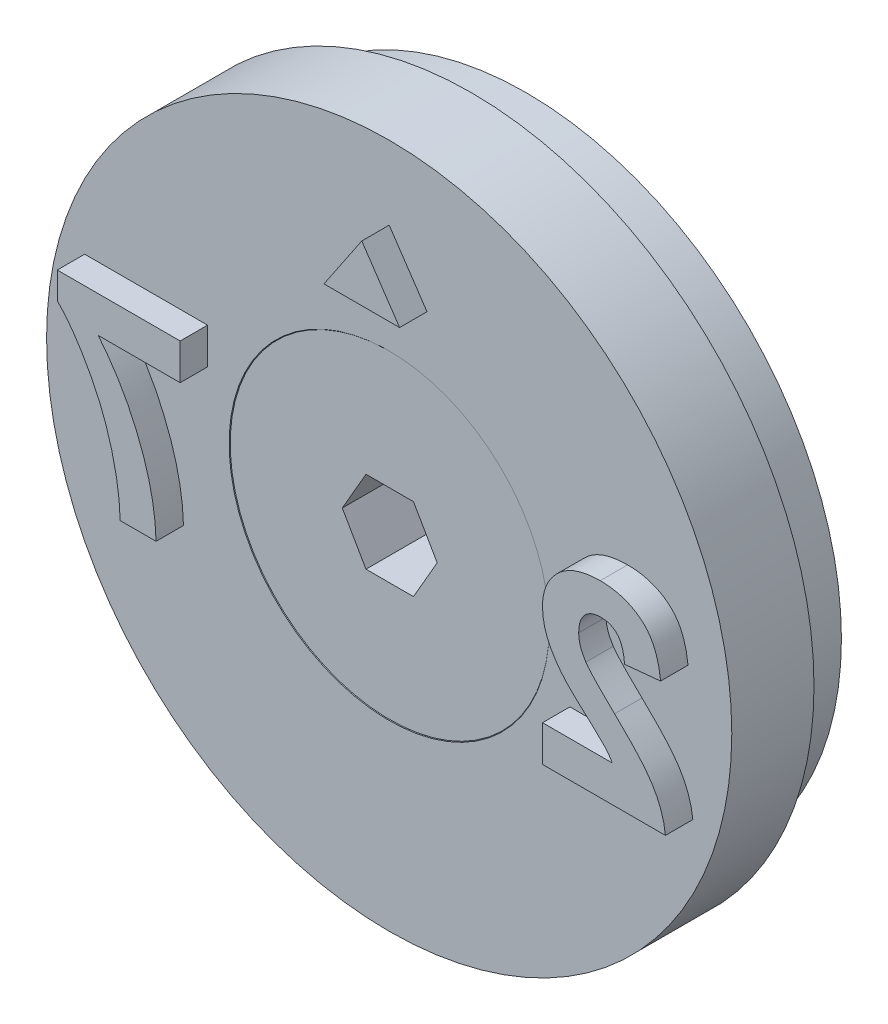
ISO-10303-21;
HEADER;
FILE_DESCRIPTION(('STEP AP214'),'2;1');
FILE_NAME('part.step','',(''),(''),'','','');
FILE_SCHEMA(('AUTOMOTIVE_DESIGN { 1 0 10303 214 1 1 1 1 }'));
ENDSEC;
DATA;
#1=APPLICATION_CONTEXT('core data for automotive mechanical design processes');
#2=APPLICATION_PROTOCOL_DEFINITION('international standard','automotive_design',2000,#1);
#3=PRODUCT_CONTEXT('',#1,'mechanical');
#4=PRODUCT('Part','Part','',(#3));
#5=PRODUCT_RELATED_PRODUCT_CATEGORY('part','',(#4));
#6=PRODUCT_DEFINITION_FORMATION('','',#4);
#7=PRODUCT_DEFINITION_CONTEXT('part definition',#1,'design');
#8=PRODUCT_DEFINITION('design','',#6,#7);
#9=PRODUCT_DEFINITION_SHAPE('','',#8);
#10=(LENGTH_UNIT() NAMED_UNIT(*) SI_UNIT(.MILLI.,.METRE.));
#11=(NAMED_UNIT(*) PLANE_ANGLE_UNIT() SI_UNIT($,.RADIAN.));
#12=(NAMED_UNIT(*) SI_UNIT($,.STERADIAN.) SOLID_ANGLE_UNIT());
#13=UNCERTAINTY_MEASURE_WITH_UNIT(LENGTH_MEASURE(1.E-05),#10,'distance_accuracy_value','');
#14=(GEOMETRIC_REPRESENTATION_CONTEXT(3) GLOBAL_UNCERTAINTY_ASSIGNED_CONTEXT((#13)) GLOBAL_UNIT_ASSIGNED_CONTEXT((#10,
#11,#12)) REPRESENTATION_CONTEXT('',''));
#15=CARTESIAN_POINT('',(0.,0.,0.));
#16=DIRECTION('',(0.,0.,1.));
#17=DIRECTION('',(1.,0.,0.));
#18=AXIS2_PLACEMENT_3D('',#15,#16,#17);
#19=CARTESIAN_POINT('',(0.,0.,-0.0199999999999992));
#20=DIRECTION('',(0.,0.,1.));
#21=DIRECTION('',(1.,0.,0.));
#22=AXIS2_PLACEMENT_3D('',#19,#20,#21);
#23=CYLINDRICAL_SURFACE('',#22,2.5);
#24=CARTESIAN_POINT('',(0.,0.,-3.34));
#25=DIRECTION('',(0.,0.,1.));
#26=DIRECTION('',(1.,0.,0.));
#27=AXIS2_PLACEMENT_3D('',#24,#25,#26);
#28=CIRCLE('',#27,2.5);
#29=CARTESIAN_POINT('',(2.5,0.,-3.34));
#30=VERTEX_POINT('',#29);
#31=EDGE_CURVE('E12',#30,#30,#28,.T.);
#32=ORIENTED_EDGE('',*,*,#31,.F.);
#33=EDGE_LOOP('',(#32));
#34=FACE_BOUND('',#33,.T.);
#35=CARTESIAN_POINT('',(0.,0.,-9.77));
#36=DIRECTION('',(0.,0.,1.));
#37=DIRECTION('',(1.,0.,0.));
#38=AXIS2_PLACEMENT_3D('',#35,#36,#37);
#39=CIRCLE('',#38,2.5);
#40=CARTESIAN_POINT('',(2.5,0.,-9.77));
#41=VERTEX_POINT('',#40);
#42=EDGE_CURVE('E151',#41,#41,#39,.T.);
#43=ORIENTED_EDGE('',*,*,#42,.T.);
#44=EDGE_LOOP('',(#43));
#45=FACE_BOUND('',#44,.T.);
#46=ADVANCED_FACE('F50',(#34,#45),#23,.T.);
#47=CARTESIAN_POINT('',(0.,0.,-3.34));
#48=DIRECTION('',(0.,0.,1.));
#49=DIRECTION('',(1.,0.,0.));
#50=AXIS2_PLACEMENT_3D('',#47,#48,#49);
#51=CONICAL_SURFACE('',#50,2.5,0.785398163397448);
#52=CARTESIAN_POINT('',(0.,0.,-0.0199999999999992));
#53=DIRECTION('',(0.,0.,1.));
#54=DIRECTION('',(1.,0.,0.));
#55=AXIS2_PLACEMENT_3D('',#52,#53,#54);
#56=CIRCLE('',#55,5.82);
#57=CARTESIAN_POINT('',(5.82,0.,-0.0199999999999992));
#58=VERTEX_POINT('',#57);
#59=EDGE_CURVE('E57',#58,#58,#56,.T.);
#60=ORIENTED_EDGE('',*,*,#59,.F.);
#61=EDGE_LOOP('',(#60));
#62=FACE_BOUND('',#61,.T.);
#63=ORIENTED_EDGE('',*,*,#31,.T.);
#64=EDGE_LOOP('',(#63));
#65=FACE_BOUND('',#64,.T.);
#66=ADVANCED_FACE('F166',(#62,#65),#51,.T.);
#67=CARTESIAN_POINT('',(0.,5.82,-0.0199999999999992));
#68=DIRECTION('',(0.,0.,-1.));
#69=DIRECTION('',(-1.,0.,0.));
#70=AXIS2_PLACEMENT_3D('',#67,#68,#69);
#71=PLANE('',#70);
#72=DIRECTION('',(1.,0.,0.));
#73=VECTOR('',#72,1.);
#74=CARTESIAN_POINT('',(-0.866025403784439,-1.5,-0.0199999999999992));
#75=LINE('',#74,#73);
#76=CARTESIAN_POINT('',(-0.866025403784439,-1.5,-0.0199999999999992));
#77=VERTEX_POINT('',#76);
#78=CARTESIAN_POINT('',(0.866025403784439,-1.5,-0.0199999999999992));
#79=VERTEX_POINT('',#78);
#80=EDGE_CURVE('E138',#77,#79,#75,.T.);
#81=ORIENTED_EDGE('',*,*,#80,.F.);
#82=DIRECTION('',(0.5,-0.866025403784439,0.));
#83=VECTOR('',#82,1.);
#84=CARTESIAN_POINT('',(-1.73205080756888,0.,-0.0199999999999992));
#85=LINE('',#84,#83);
#86=CARTESIAN_POINT('',(-1.73205080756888,0.,-0.0199999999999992));
#87=VERTEX_POINT('',#86);
#88=EDGE_CURVE('E64',#87,#77,#85,.T.);
#89=ORIENTED_EDGE('',*,*,#88,.F.);
#90=DIRECTION('',(-0.5,-0.866025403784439,0.));
#91=VECTOR('',#90,1.);
#92=CARTESIAN_POINT('',(-0.866025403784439,1.5,-0.0199999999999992));
#93=LINE('',#92,#91);
#94=CARTESIAN_POINT('',(-0.866025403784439,1.5,-0.0199999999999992));
#95=VERTEX_POINT('',#94);
#96=EDGE_CURVE('E147',#95,#87,#93,.T.);
#97=ORIENTED_EDGE('',*,*,#96,.F.);
#98=DIRECTION('',(-1.,0.,0.));
#99=VECTOR('',#98,1.);
#100=CARTESIAN_POINT('',(0.866025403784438,1.5,-0.0199999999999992));
#101=LINE('',#100,#99);
#102=CARTESIAN_POINT('',(0.866025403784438,1.5,-0.0199999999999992));
#103=VERTEX_POINT('',#102);
#104=EDGE_CURVE('E145',#103,#95,#101,.T.);
#105=ORIENTED_EDGE('',*,*,#104,.F.);
#106=DIRECTION('',(-0.5,0.866025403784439,0.));
#107=VECTOR('',#106,1.);
#108=CARTESIAN_POINT('',(1.73205080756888,0.,-0.0199999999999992));
#109=LINE('',#108,#107);
#110=CARTESIAN_POINT('',(1.73205080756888,0.,-0.0199999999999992));
#111=VERTEX_POINT('',#110);
#112=EDGE_CURVE('E112',#111,#103,#109,.T.);
#113=ORIENTED_EDGE('',*,*,#112,.F.);
#114=DIRECTION('',(0.5,0.866025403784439,0.));
#115=VECTOR('',#114,1.);
#116=CARTESIAN_POINT('',(0.866025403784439,-1.5,-0.0199999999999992));
#117=LINE('',#116,#115);
#118=EDGE_CURVE('E141',#79,#111,#117,.T.);
#119=ORIENTED_EDGE('',*,*,#118,.F.);
#120=EDGE_LOOP('',(#81,#89,#97,#105,#113,#119));
#121=FACE_BOUND('',#120,.T.);
#122=ORIENTED_EDGE('',*,*,#59,.T.);
#123=EDGE_LOOP('',(#122));
#124=FACE_BOUND('',#123,.T.);
#125=ADVANCED_FACE('F164',(#121,#124),#71,.F.);
#126=CARTESIAN_POINT('',(0.,0.,-10.02));
#127=DIRECTION('',(0.,0.,1.));
#128=DIRECTION('',(1.,0.,0.));
#129=AXIS2_PLACEMENT_3D('',#126,#127,#128);
#130=PLANE('',#129);
#131=CARTESIAN_POINT('',(0.,0.,-10.02));
#132=DIRECTION('',(0.,0.,1.));
#133=DIRECTION('',(1.,0.,0.));
#134=AXIS2_PLACEMENT_3D('',#131,#132,#133);
#135=CIRCLE('',#134,2.25);
#136=CARTESIAN_POINT('',(2.25,0.,-10.02));
#137=VERTEX_POINT('',#136);
#138=EDGE_CURVE('E159',#137,#137,#135,.T.);
#139=ORIENTED_EDGE('',*,*,#138,.F.);
#140=EDGE_LOOP('',(#139));
#141=FACE_BOUND('',#140,.T.);
#142=ADVANCED_FACE('F179',(#141),#130,.F.);
#143=CARTESIAN_POINT('',(0.,0.,-10.02));
#144=DIRECTION('',(0.,0.,1.));
#145=DIRECTION('',(1.,0.,0.));
#146=AXIS2_PLACEMENT_3D('',#143,#144,#145);
#147=CONICAL_SURFACE('',#146,2.25,0.78539816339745);
#148=ORIENTED_EDGE('',*,*,#42,.F.);
#149=EDGE_LOOP('',(#148));
#150=FACE_BOUND('',#149,.T.);
#151=ORIENTED_EDGE('',*,*,#138,.T.);
#152=EDGE_LOOP('',(#151));
#153=FACE_BOUND('',#152,.T.);
#154=ADVANCED_FACE('F175',(#150,#153),#147,.T.);
#155=CARTESIAN_POINT('',(-1.73205080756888,0.,-2.52));
#156=DIRECTION('',(-0.866025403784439,-0.5,0.));
#157=DIRECTION('',(0.5,-0.866025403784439,0.));
#158=AXIS2_PLACEMENT_3D('',#155,#156,#157);
#159=PLANE('',#158);
#160=ORIENTED_EDGE('',*,*,#88,.T.);
#161=DIRECTION('',(0.,0.,1.));
#162=VECTOR('',#161,1.);
#163=CARTESIAN_POINT('',(-0.866025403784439,-1.5,-2.52));
#164=LINE('',#163,#162);
#165=CARTESIAN_POINT('',(-0.866025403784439,-1.5,-2.52));
#166=VERTEX_POINT('',#165);
#167=EDGE_CURVE('E94',#166,#77,#164,.T.);
#168=ORIENTED_EDGE('',*,*,#167,.F.);
#169=DIRECTION('',(0.5,-0.866025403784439,0.));
#170=VECTOR('',#169,1.);
#171=CARTESIAN_POINT('',(-1.73205080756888,0.,-2.52));
#172=LINE('',#171,#170);
#173=CARTESIAN_POINT('',(-1.73205080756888,0.,-2.52));
#174=VERTEX_POINT('',#173);
#175=EDGE_CURVE('E149',#174,#166,#172,.T.);
#176=ORIENTED_EDGE('',*,*,#175,.F.);
#177=DIRECTION('',(0.,0.,1.));
#178=VECTOR('',#177,1.);
#179=CARTESIAN_POINT('',(-1.73205080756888,0.,-2.52));
#180=LINE('',#179,#178);
#181=EDGE_CURVE('E72',#174,#87,#180,.T.);
#182=ORIENTED_EDGE('',*,*,#181,.T.);
#183=EDGE_LOOP('',(#160,#168,#176,#182));
#184=FACE_BOUND('',#183,.T.);
#185=ADVANCED_FACE('F178',(#184),#159,.F.);
#186=CARTESIAN_POINT('',(-0.866025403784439,1.5,-2.52));
#187=DIRECTION('',(-0.866025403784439,0.5,0.));
#188=DIRECTION('',(-0.5,-0.866025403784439,0.));
#189=AXIS2_PLACEMENT_3D('',#186,#187,#188);
#190=PLANE('',#189);
#191=ORIENTED_EDGE('',*,*,#96,.T.);
#192=ORIENTED_EDGE('',*,*,#181,.F.);
#193=DIRECTION('',(-0.5,-0.866025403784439,0.));
#194=VECTOR('',#193,1.);
#195=CARTESIAN_POINT('',(-0.866025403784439,1.5,-2.52));
#196=LINE('',#195,#194);
#197=CARTESIAN_POINT('',(-0.866025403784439,1.5,-2.52));
#198=VERTEX_POINT('',#197);
#199=EDGE_CURVE('E124',#198,#174,#196,.T.);
#200=ORIENTED_EDGE('',*,*,#199,.F.);
#201=DIRECTION('',(0.,0.,1.));
#202=VECTOR('',#201,1.);
#203=CARTESIAN_POINT('',(-0.866025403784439,1.5,-2.52));
#204=LINE('',#203,#202);
#205=EDGE_CURVE('E116',#198,#95,#204,.T.);
#206=ORIENTED_EDGE('',*,*,#205,.T.);
#207=EDGE_LOOP('',(#191,#192,#200,#206));
#208=FACE_BOUND('',#207,.T.);
#209=ADVANCED_FACE('F193',(#208),#190,.F.);
#210=CARTESIAN_POINT('',(0.866025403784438,1.5,-2.52));
#211=DIRECTION('',(0.,1.,0.));
#212=DIRECTION('',(-1.,0.,0.));
#213=AXIS2_PLACEMENT_3D('',#210,#211,#212);
#214=PLANE('',#213);
#215=ORIENTED_EDGE('',*,*,#104,.T.);
#216=ORIENTED_EDGE('',*,*,#205,.F.);
#217=DIRECTION('',(-1.,0.,0.));
#218=VECTOR('',#217,1.);
#219=CARTESIAN_POINT('',(0.866025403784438,1.5,-2.52));
#220=LINE('',#219,#218);
#221=CARTESIAN_POINT('',(0.866025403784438,1.5,-2.52));
#222=VERTEX_POINT('',#221);
#223=EDGE_CURVE('E120',#222,#198,#220,.T.);
#224=ORIENTED_EDGE('',*,*,#223,.F.);
#225=DIRECTION('',(0.,0.,1.));
#226=VECTOR('',#225,1.);
#227=CARTESIAN_POINT('',(0.866025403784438,1.5,-2.52));
#228=LINE('',#227,#226);
#229=EDGE_CURVE('E105',#222,#103,#228,.T.);
#230=ORIENTED_EDGE('',*,*,#229,.T.);
#231=EDGE_LOOP('',(#215,#216,#224,#230));
#232=FACE_BOUND('',#231,.T.);
#233=ADVANCED_FACE('F121',(#232),#214,.F.);
#234=CARTESIAN_POINT('',(1.73205080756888,0.,-2.52));
#235=DIRECTION('',(0.866025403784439,0.5,0.));
#236=DIRECTION('',(-0.5,0.866025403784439,0.));
#237=AXIS2_PLACEMENT_3D('',#234,#235,#236);
#238=PLANE('',#237);
#239=ORIENTED_EDGE('',*,*,#112,.T.);
#240=ORIENTED_EDGE('',*,*,#229,.F.);
#241=DIRECTION('',(-0.5,0.866025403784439,0.));
#242=VECTOR('',#241,1.);
#243=CARTESIAN_POINT('',(1.73205080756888,0.,-2.52));
#244=LINE('',#243,#242);
#245=CARTESIAN_POINT('',(1.73205080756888,0.,-2.52));
#246=VERTEX_POINT('',#245);
#247=EDGE_CURVE('E109',#246,#222,#244,.T.);
#248=ORIENTED_EDGE('',*,*,#247,.F.);
#249=DIRECTION('',(0.,0.,1.));
#250=VECTOR('',#249,1.);
#251=CARTESIAN_POINT('',(1.73205080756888,0.,-2.52));
#252=LINE('',#251,#250);
#253=EDGE_CURVE('E117',#246,#111,#252,.T.);
#254=ORIENTED_EDGE('',*,*,#253,.T.);
#255=EDGE_LOOP('',(#239,#240,#248,#254));
#256=FACE_BOUND('',#255,.T.);
#257=ADVANCED_FACE('F107',(#256),#238,.F.);
#258=CARTESIAN_POINT('',(0.866025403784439,-1.5,-2.52));
#259=DIRECTION('',(0.866025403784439,-0.5,0.));
#260=DIRECTION('',(0.5,0.866025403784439,0.));
#261=AXIS2_PLACEMENT_3D('',#258,#259,#260);
#262=PLANE('',#261);
#263=ORIENTED_EDGE('',*,*,#118,.T.);
#264=ORIENTED_EDGE('',*,*,#253,.F.);
#265=DIRECTION('',(0.5,0.866025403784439,0.));
#266=VECTOR('',#265,1.);
#267=CARTESIAN_POINT('',(0.866025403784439,-1.5,-2.52));
#268=LINE('',#267,#266);
#269=CARTESIAN_POINT('',(0.866025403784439,-1.5,-2.52));
#270=VERTEX_POINT('',#269);
#271=EDGE_CURVE('E130',#270,#246,#268,.T.);
#272=ORIENTED_EDGE('',*,*,#271,.F.);
#273=DIRECTION('',(0.,0.,1.));
#274=VECTOR('',#273,1.);
#275=CARTESIAN_POINT('',(0.866025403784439,-1.5,-2.52));
#276=LINE('',#275,#274);
#277=EDGE_CURVE('E154',#270,#79,#276,.T.);
#278=ORIENTED_EDGE('',*,*,#277,.T.);
#279=EDGE_LOOP('',(#263,#264,#272,#278));
#280=FACE_BOUND('',#279,.T.);
#281=ADVANCED_FACE('F197',(#280),#262,.F.);
#282=CARTESIAN_POINT('',(-0.866025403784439,-1.5,-2.52));
#283=DIRECTION('',(0.,-1.,0.));
#284=DIRECTION('',(0.,0.,-1.));
#285=AXIS2_PLACEMENT_3D('',#282,#283,#284);
#286=PLANE('',#285);
#287=ORIENTED_EDGE('',*,*,#80,.T.);
#288=ORIENTED_EDGE('',*,*,#277,.F.);
#289=DIRECTION('',(1.,0.,0.));
#290=VECTOR('',#289,1.);
#291=CARTESIAN_POINT('',(-0.866025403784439,-1.5,-2.52));
#292=LINE('',#291,#290);
#293=EDGE_CURVE('E132',#166,#270,#292,.T.);
#294=ORIENTED_EDGE('',*,*,#293,.F.);
#295=ORIENTED_EDGE('',*,*,#167,.T.);
#296=EDGE_LOOP('',(#287,#288,#294,#295));
#297=FACE_BOUND('',#296,.T.);
#298=ADVANCED_FACE('F194',(#297),#286,.F.);
#299=CARTESIAN_POINT('',(0.,0.,-2.52));
#300=DIRECTION('',(0.,0.,1.));
#301=DIRECTION('',(1.,0.,0.));
#302=AXIS2_PLACEMENT_3D('',#299,#300,#301);
#303=PLANE('',#302);
#304=ORIENTED_EDGE('',*,*,#175,.T.);
#305=ORIENTED_EDGE('',*,*,#293,.T.);
#306=ORIENTED_EDGE('',*,*,#271,.T.);
#307=ORIENTED_EDGE('',*,*,#247,.T.);
#308=ORIENTED_EDGE('',*,*,#223,.T.);
#309=ORIENTED_EDGE('',*,*,#199,.T.);
#310=EDGE_LOOP('',(#304,#305,#306,#307,#308,#309));
#311=FACE_BOUND('',#310,.T.);
#312=ADVANCED_FACE('F127',(#311),#303,.T.);
#313=CLOSED_SHELL('',(#46,#66,#125,#142,#154,#185,#209,#233,#257,#281,#298,#312));
#314=MANIFOLD_SOLID_BREP('B2',#313);
#315=CARTESIAN_POINT('',(1.3800444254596,7.76799984,1.));
#316=DIRECTION('',(-0.829037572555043,-0.559192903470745,0.));
#317=DIRECTION('',(0.559192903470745,-0.829037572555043,0.));
#318=AXIS2_PLACEMENT_3D('',#315,#316,#317);
#319=PLANE('',#318);
#320=DIRECTION('',(-0.559192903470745,0.829037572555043,0.));
#321=VECTOR('',#320,1.);
#322=CARTESIAN_POINT('',(1.3800444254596,7.76799984,0.));
#323=LINE('',#322,#321);
#324=CARTESIAN_POINT('',(1.3800444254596,7.76799984,0.));
#325=VERTEX_POINT('',#324);
#326=CARTESIAN_POINT('',(0.,9.81399984,0.));
#327=VERTEX_POINT('',#326);
#328=EDGE_CURVE('E366',#325,#327,#323,.T.);
#329=ORIENTED_EDGE('',*,*,#328,.T.);
#330=DIRECTION('',(0.,0.,-1.));
#331=VECTOR('',#330,1.);
#332=CARTESIAN_POINT('',(0.,9.81399984,1.));
#333=LINE('',#332,#331);
#334=CARTESIAN_POINT('',(0.,9.81399984,1.));
#335=VERTEX_POINT('',#334);
#336=EDGE_CURVE('E48',#335,#327,#333,.T.);
#337=ORIENTED_EDGE('',*,*,#336,.F.);
#338=DIRECTION('',(-0.559192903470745,0.829037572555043,0.));
#339=VECTOR('',#338,1.);
#340=CARTESIAN_POINT('',(1.3800444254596,7.76799984,1.));
#341=LINE('',#340,#339);
#342=CARTESIAN_POINT('',(1.3800444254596,7.76799984,1.));
#343=VERTEX_POINT('',#342);
#344=EDGE_CURVE('E359',#343,#335,#341,.T.);
#345=ORIENTED_EDGE('',*,*,#344,.F.);
#346=DIRECTION('',(0.,0.,-1.));
#347=VECTOR('',#346,1.);
#348=CARTESIAN_POINT('',(1.3800444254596,7.76799984,1.));
#349=LINE('',#348,#347);
#350=EDGE_CURVE('E367',#343,#325,#349,.T.);
#351=ORIENTED_EDGE('',*,*,#350,.T.);
#352=EDGE_LOOP('',(#329,#337,#345,#351));
#353=FACE_BOUND('',#352,.T.);
#354=ADVANCED_FACE('F319',(#353),#319,.F.);
#355=CARTESIAN_POINT('',(0.,9.81399984,1.));
#356=DIRECTION('',(0.829037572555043,-0.559192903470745,0.));
#357=DIRECTION('',(0.559192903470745,0.829037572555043,0.));
#358=AXIS2_PLACEMENT_3D('',#355,#356,#357);
#359=PLANE('',#358);
#360=DIRECTION('',(-0.559192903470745,-0.829037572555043,0.));
#361=VECTOR('',#360,1.);
#362=CARTESIAN_POINT('',(0.,9.81399984,0.));
#363=LINE('',#362,#361);
#364=CARTESIAN_POINT('',(-1.3800444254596,7.76799984,0.));
#365=VERTEX_POINT('',#364);
#366=EDGE_CURVE('E347',#327,#365,#363,.T.);
#367=ORIENTED_EDGE('',*,*,#366,.T.);
#368=DIRECTION('',(0.,0.,-1.));
#369=VECTOR('',#368,1.);
#370=CARTESIAN_POINT('',(-1.3800444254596,7.76799984,1.));
#371=LINE('',#370,#369);
#372=CARTESIAN_POINT('',(-1.3800444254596,7.76799984,1.));
#373=VERTEX_POINT('',#372);
#374=EDGE_CURVE('E327',#373,#365,#371,.T.);
#375=ORIENTED_EDGE('',*,*,#374,.F.);
#376=DIRECTION('',(-0.559192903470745,-0.829037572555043,0.));
#377=VECTOR('',#376,1.);
#378=CARTESIAN_POINT('',(0.,9.81399984,1.));
#379=LINE('',#378,#377);
#380=EDGE_CURVE('E355',#335,#373,#379,.T.);
#381=ORIENTED_EDGE('',*,*,#380,.F.);
#382=ORIENTED_EDGE('',*,*,#336,.T.);
#383=EDGE_LOOP('',(#367,#375,#381,#382));
#384=FACE_BOUND('',#383,.T.);
#385=ADVANCED_FACE('F356',(#384),#359,.F.);
#386=CARTESIAN_POINT('',(-1.3800444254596,7.76799984,1.));
#387=DIRECTION('',(0.,1.,0.));
#388=DIRECTION('',(0.,0.,1.));
#389=AXIS2_PLACEMENT_3D('',#386,#387,#388);
#390=PLANE('',#389);
#391=DIRECTION('',(1.,0.,0.));
#392=VECTOR('',#391,1.);
#393=CARTESIAN_POINT('',(-1.3800444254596,7.76799984,0.));
#394=LINE('',#393,#392);
#395=EDGE_CURVE('E352',#365,#325,#394,.T.);
#396=ORIENTED_EDGE('',*,*,#395,.T.);
#397=ORIENTED_EDGE('',*,*,#350,.F.);
#398=DIRECTION('',(1.,0.,0.));
#399=VECTOR('',#398,1.);
#400=CARTESIAN_POINT('',(-1.3800444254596,7.76799984,1.));
#401=LINE('',#400,#399);
#402=EDGE_CURVE('E335',#373,#343,#401,.T.);
#403=ORIENTED_EDGE('',*,*,#402,.F.);
#404=ORIENTED_EDGE('',*,*,#374,.T.);
#405=EDGE_LOOP('',(#396,#397,#403,#404));
#406=FACE_BOUND('',#405,.T.);
#407=ADVANCED_FACE('F374',(#406),#390,.F.);
#408=CARTESIAN_POINT('',(0.,0.,1.));
#409=DIRECTION('',(0.,0.,1.));
#410=DIRECTION('',(1.,0.,0.));
#411=AXIS2_PLACEMENT_3D('',#408,#409,#410);
#412=PLANE('',#411);
#413=ORIENTED_EDGE('',*,*,#344,.T.);
#414=ORIENTED_EDGE('',*,*,#380,.T.);
#415=ORIENTED_EDGE('',*,*,#402,.T.);
#416=EDGE_LOOP('',(#413,#414,#415));
#417=FACE_BOUND('',#416,.T.);
#418=ADVANCED_FACE('F362',(#417),#412,.T.);
#419=CARTESIAN_POINT('',(0.,0.,0.));
#420=DIRECTION('',(0.,0.,1.));
#421=DIRECTION('',(1.,0.,0.));
#422=AXIS2_PLACEMENT_3D('',#419,#420,#421);
#423=PLANE('',#422);
#424=ORIENTED_EDGE('',*,*,#328,.F.);
#425=ORIENTED_EDGE('',*,*,#395,.F.);
#426=ORIENTED_EDGE('',*,*,#366,.F.);
#427=EDGE_LOOP('',(#424,#425,#426));
#428=FACE_BOUND('',#427,.T.);
#429=ADVANCED_FACE('F375',(#428),#423,.F.);
#430=CLOSED_SHELL('',(#354,#385,#407,#418,#429));
#431=MANIFOLD_SOLID_BREP('B6',#430);
#432=CARTESIAN_POINT('',(0.,12.5,0.));
#433=DIRECTION('',(0.,0.,-1.));
#434=DIRECTION('',(-1.,0.,0.));
#435=AXIS2_PLACEMENT_3D('',#432,#433,#434);
#436=PLANE('',#435);
#437=DIRECTION('',(-1.,0.,0.));
#438=VECTOR('',#437,1.);
#439=CARTESIAN_POINT('',(9.14262620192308,-2.11015384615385,0.));
#440=LINE('',#439,#438);
#441=CARTESIAN_POINT('',(9.14262620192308,-2.11015384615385,0.));
#442=VERTEX_POINT('',#441);
#443=CARTESIAN_POINT('',(6.59423076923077,-2.11015384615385,0.));
#444=VERTEX_POINT('',#443);
#445=EDGE_CURVE('E585',#442,#444,#440,.T.);
#446=ORIENTED_EDGE('',*,*,#445,.F.);
#447=CARTESIAN_POINT('',(7.25914903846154,-0.156612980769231,0.));
#448=CARTESIAN_POINT('',(7.28000828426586,-0.182885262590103,0.));
#449=CARTESIAN_POINT('',(7.3246839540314,-0.239154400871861,0.));
#450=CARTESIAN_POINT('',(7.40068900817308,-0.325434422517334,0.));
#451=CARTESIAN_POINT('',(7.48877232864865,-0.419679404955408,0.));
#452=CARTESIAN_POINT('',(7.58768977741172,-0.523653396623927,0.));
#453=CARTESIAN_POINT('',(7.70070879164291,-0.6336743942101,0.));
#454=CARTESIAN_POINT('',(7.82376294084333,-0.754343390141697,0.));
#455=CARTESIAN_POINT('',(7.96226696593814,-0.87948776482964,0.));
#456=CARTESIAN_POINT('',(8.10572357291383,-1.0122292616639,0.));
#457=CARTESIAN_POINT('',(8.24980374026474,-1.14142469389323,0.));
#458=CARTESIAN_POINT('',(8.38223418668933,-1.2641317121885,0.));
#459=CARTESIAN_POINT('',(8.50252509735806,-1.37270106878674,0.));
#460=CARTESIAN_POINT('',(8.6050742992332,-1.47312629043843,0.));
#461=CARTESIAN_POINT('',(8.69591371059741,-1.55855342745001,0.));
#462=CARTESIAN_POINT('',(8.77176917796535,-1.63336308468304,0.));
#463=CARTESIAN_POINT('',(8.83406013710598,-1.69574418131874,0.));
#464=CARTESIAN_POINT('',(8.91989306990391,-1.79298048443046,0.));
#465=CARTESIAN_POINT('',(9.02910573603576,-1.92449262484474,0.));
#466=CARTESIAN_POINT('',(9.10594131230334,-2.05015619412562,0.));
#467=CARTESIAN_POINT('',(9.14262620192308,-2.11015384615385,0.));
#468=B_SPLINE_CURVE_WITH_KNOTS('',3,(#447,#448,#449,#450,#451,#452,#453,#454,#455,#456,#457,
#458,#459,#460,#461,#462,#463,#464,#465,#466,#467),.UNSPECIFIED.,.F.,.F.,(4,1,1,1,1,1,1,1,1,1,1,
1,1,1,1,1,1,1,4),(0.,0.0369753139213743,0.0791925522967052,0.126700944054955,0.179184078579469,
0.237368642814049,0.300558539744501,0.369153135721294,0.443112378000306,0.516018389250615,
0.582473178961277,0.642136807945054,0.694619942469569,0.740679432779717,0.779589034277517,
0.812073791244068,0.837814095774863,0.922564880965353,1.),.UNSPECIFIED.);
#469=CARTESIAN_POINT('',(7.25914903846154,-0.156612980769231,0.));
#470=VERTEX_POINT('',#469);
#471=EDGE_CURVE('E598',#470,#442,#468,.T.);
#472=ORIENTED_EDGE('',*,*,#471,.F.);
#473=CARTESIAN_POINT('',(6.59423076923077,1.56338221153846,0.));
#474=CARTESIAN_POINT('',(6.59590865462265,1.48862686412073,0.));
#475=CARTESIAN_POINT('',(6.59923732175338,1.34032372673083,0.));
#476=CARTESIAN_POINT('',(6.63110683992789,1.12108738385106,0.));
#477=CARTESIAN_POINT('',(6.67979725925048,0.906906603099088,0.));
#478=CARTESIAN_POINT('',(6.75175786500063,0.69725794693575,0.));
#479=CARTESIAN_POINT('',(6.84297351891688,0.487112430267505,0.));
#480=CARTESIAN_POINT('',(6.96055268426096,0.275998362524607,0.));
#481=CARTESIAN_POINT('',(7.09707098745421,0.0575489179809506,0.));
#482=CARTESIAN_POINT('',(7.20395943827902,-0.0836881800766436,0.));
#483=CARTESIAN_POINT('',(7.25914903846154,-0.156612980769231,0.));
#484=B_SPLINE_CURVE_WITH_KNOTS('',3,(#473,#474,#475,#476,#477,#478,#479,#480,#481,#482,#483),
.UNSPECIFIED.,.F.,.F.,(4,1,1,1,1,1,1,1,4),(0.,0.119176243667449,0.236427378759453,
0.352663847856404,0.469086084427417,0.589462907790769,0.717601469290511,0.854189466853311,1.),.UNSPECIFIED.);
#485=CARTESIAN_POINT('',(6.59423076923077,1.56338221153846,0.));
#486=VERTEX_POINT('',#485);
#487=EDGE_CURVE('E831',#486,#470,#484,.T.);
#488=ORIENTED_EDGE('',*,*,#487,.F.);
#489=CARTESIAN_POINT('',(8.69888942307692,3.429,0.));
#490=CARTESIAN_POINT('',(8.6191501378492,3.42746745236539,0.));
#491=CARTESIAN_POINT('',(8.46384786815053,3.42448262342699,0.));
#492=CARTESIAN_POINT('',(8.23713412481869,3.39983388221,0.));
#493=CARTESIAN_POINT('',(8.02415285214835,3.35685523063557,0.));
#494=CARTESIAN_POINT('',(7.82304201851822,3.2999239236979,0.));
#495=CARTESIAN_POINT('',(7.63586692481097,3.22391646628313,0.));
#496=CARTESIAN_POINT('',(7.46106784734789,3.13202661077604,0.));
#497=CARTESIAN_POINT('',(7.30139581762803,3.02076695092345,0.));
#498=CARTESIAN_POINT('',(7.15447070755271,2.89620494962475,0.));
#499=CARTESIAN_POINT('',(7.02313141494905,2.75922713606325,0.));
#500=CARTESIAN_POINT('',(6.90809007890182,2.61311713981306,0.));
#501=CARTESIAN_POINT('',(6.81170882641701,2.45797675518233,0.));
#502=CARTESIAN_POINT('',(6.73083015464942,2.29569697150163,0.));
#503=CARTESIAN_POINT('',(6.67077828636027,2.12366647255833,0.));
#504=CARTESIAN_POINT('',(6.62702188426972,1.94426396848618,0.));
#505=CARTESIAN_POINT('',(6.59800962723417,1.75665250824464,0.));
#506=CARTESIAN_POINT('',(6.59550431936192,1.62851813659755,0.));
#507=CARTESIAN_POINT('',(6.59423076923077,1.56338221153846,0.));
#508=B_SPLINE_CURVE_WITH_KNOTS('',3,(#489,#490,#491,#492,#493,#494,#495,#496,#497,#498,#499,
#500,#501,#502,#503,#504,#505,#506,#507),.UNSPECIFIED.,.F.,.F.,(4,1,1,1,1,1,1,1,1,1,1,1,1,1,1,1,
4),(0.,0.0756723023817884,0.147381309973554,0.216084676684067,0.28169803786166,
0.345459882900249,0.407485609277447,0.468731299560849,0.529782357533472,0.590032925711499,
0.648548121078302,0.70595351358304,0.763101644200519,0.820289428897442,0.878479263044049,
0.938226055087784,1.),.UNSPECIFIED.);
#509=CARTESIAN_POINT('',(8.69888942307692,3.429,0.));
#510=VERTEX_POINT('',#509);
#511=EDGE_CURVE('E823',#510,#486,#508,.T.);
#512=ORIENTED_EDGE('',*,*,#511,.F.);
#513=CARTESIAN_POINT('',(10.9024615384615,1.36006009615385,0.));
#514=CARTESIAN_POINT('',(10.891858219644,1.4490988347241,0.));
#515=CARTESIAN_POINT('',(10.8713000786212,1.62173072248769,0.));
#516=CARTESIAN_POINT('',(10.8199968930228,1.86968963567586,0.));
#517=CARTESIAN_POINT('',(10.7550233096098,2.09844292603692,0.));
#518=CARTESIAN_POINT('',(10.6732818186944,2.3075660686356,0.));
#519=CARTESIAN_POINT('',(10.5781508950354,2.49838888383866,0.));
#520=CARTESIAN_POINT('',(10.4647780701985,2.66804795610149,0.));
#521=CARTESIAN_POINT('',(10.3371247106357,2.81842262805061,0.));
#522=CARTESIAN_POINT('',(10.1950804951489,2.94943286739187,0.));
#523=CARTESIAN_POINT('',(10.0395484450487,3.06149545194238,0.));
#524=CARTESIAN_POINT('',(9.8763454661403,3.1615285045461,0.));
#525=CARTESIAN_POINT('',(9.70228211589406,3.2435874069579,0.));
#526=CARTESIAN_POINT('',(9.51927483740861,3.311216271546,0.));
#527=CARTESIAN_POINT('',(9.32740633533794,3.36526471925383,0.));
#528=CARTESIAN_POINT('',(9.12578919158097,3.40100082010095,0.));
#529=CARTESIAN_POINT('',(8.91566771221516,3.42613773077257,0.));
#530=CARTESIAN_POINT('',(8.77223791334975,3.4280315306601,0.));
#531=CARTESIAN_POINT('',(8.69888942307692,3.429,0.));
#532=B_SPLINE_CURVE_WITH_KNOTS('',3,(#513,#514,#515,#516,#517,#518,#519,#520,#521,#522,#523,
#524,#525,#526,#527,#528,#529,#530,#531),.UNSPECIFIED.,.F.,.F.,(4,1,1,1,1,1,1,1,1,1,1,1,1,1,1,1,
4),(0.,0.0794357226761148,0.154013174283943,0.224141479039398,0.289934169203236,
0.352732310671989,0.412725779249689,0.470302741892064,0.527168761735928,0.583502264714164,
0.639948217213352,0.696584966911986,0.753726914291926,0.812707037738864,0.872963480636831,
0.93503486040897,1.),.UNSPECIFIED.);
#533=CARTESIAN_POINT('',(10.9024615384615,1.36006009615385,0.));
#534=VERTEX_POINT('',#533);
#535=EDGE_CURVE('E818',#534,#510,#532,.T.);
#536=ORIENTED_EDGE('',*,*,#535,.F.);
#537=DIRECTION('',(0.995240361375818,0.0974506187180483,0.));
#538=VECTOR('',#537,1.);
#539=CARTESIAN_POINT('',(9.58361538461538,1.23092307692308,0.));
#540=LINE('',#539,#538);
#541=CARTESIAN_POINT('',(9.58361538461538,1.23092307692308,0.));
#542=VERTEX_POINT('',#541);
#543=EDGE_CURVE('E812',#542,#534,#540,.T.);
#544=ORIENTED_EDGE('',*,*,#543,.F.);
#545=CARTESIAN_POINT('',(8.72636538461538,2.286,0.));
#546=CARTESIAN_POINT('',(8.78618248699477,2.28328991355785,0.));
#547=CARTESIAN_POINT('',(8.90173621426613,2.27805461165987,0.));
#548=CARTESIAN_POINT('',(9.06596313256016,2.23231973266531,0.));
#549=CARTESIAN_POINT('',(9.2096313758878,2.15314784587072,0.));
#550=CARTESIAN_POINT('',(9.31201700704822,2.0629238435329,0.));
#551=CARTESIAN_POINT('',(9.38118335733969,1.9751875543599,0.));
#552=CARTESIAN_POINT('',(9.4283108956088,1.89873115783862,0.));
#553=CARTESIAN_POINT('',(9.46893115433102,1.81185324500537,0.));
#554=CARTESIAN_POINT('',(9.50492409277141,1.71553191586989,0.));
#555=CARTESIAN_POINT('',(9.53335444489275,1.60866370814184,0.));
#556=CARTESIAN_POINT('',(9.55625048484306,1.49206253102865,0.));
#557=CARTESIAN_POINT('',(9.57470138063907,1.3651009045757,0.));
#558=CARTESIAN_POINT('',(9.58056909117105,1.27677733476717,0.));
#559=CARTESIAN_POINT('',(9.58361538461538,1.23092307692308,0.));
#560=B_SPLINE_CURVE_WITH_KNOTS('',3,(#545,#546,#547,#548,#549,#550,#551,#552,#553,#554,#555,
#556,#557,#558,#559),.UNSPECIFIED.,.F.,.F.,(4,1,1,1,1,1,1,1,1,1,1,1,4),(0.,0.116899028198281,
0.225823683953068,0.330086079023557,0.435451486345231,0.490306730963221,0.548244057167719,
0.610766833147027,0.677675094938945,0.749188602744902,0.826858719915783,0.910111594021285,1.),.UNSPECIFIED.);
#561=CARTESIAN_POINT('',(8.72636538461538,2.286,0.));
#562=VERTEX_POINT('',#561);
#563=EDGE_CURVE('E804',#562,#542,#560,.T.);
#564=ORIENTED_EDGE('',*,*,#563,.F.);
#565=CARTESIAN_POINT('',(7.91307692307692,1.38616225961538,0.));
#566=CARTESIAN_POINT('',(7.91554694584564,1.4545870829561,0.));
#567=CARTESIAN_POINT('',(7.92022003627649,1.58404151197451,0.));
#568=CARTESIAN_POINT('',(7.95940470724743,1.76672564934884,0.));
#569=CARTESIAN_POINT('',(8.02889236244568,1.92376854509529,0.));
#570=CARTESIAN_POINT('',(8.12456407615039,2.05565224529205,0.));
#571=CARTESIAN_POINT('',(8.24554114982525,2.15898261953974,0.));
#572=CARTESIAN_POINT('',(8.38696686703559,2.23533373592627,0.));
#573=CARTESIAN_POINT('',(8.5509114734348,2.27754595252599,0.));
#574=CARTESIAN_POINT('',(8.66614141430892,2.28309817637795,0.));
#575=CARTESIAN_POINT('',(8.72636538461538,2.286,0.));
#576=B_SPLINE_CURVE_WITH_KNOTS('',3,(#565,#566,#567,#568,#569,#570,#571,#572,#573,#574,#575),
.UNSPECIFIED.,.F.,.F.,(4,1,1,1,1,1,1,1,4),(0.,0.149140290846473,0.282161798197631,
0.404655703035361,0.521109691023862,0.63441645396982,0.748796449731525,0.868710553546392,1.),.UNSPECIFIED.);
#577=CARTESIAN_POINT('',(7.91307692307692,1.38616225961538,0.));
#578=VERTEX_POINT('',#577);
#579=EDGE_CURVE('E796',#578,#562,#576,.T.);
#580=ORIENTED_EDGE('',*,*,#579,.F.);
#581=CARTESIAN_POINT('',(8.17409855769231,0.593480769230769,0.));
#582=CARTESIAN_POINT('',(8.13439107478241,0.659439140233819,0.));
#583=CARTESIAN_POINT('',(8.05779994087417,0.786665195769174,0.));
#584=CARTESIAN_POINT('',(7.97381140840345,0.986730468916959,0.));
#585=CARTESIAN_POINT('',(7.9233983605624,1.18675441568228,0.));
#586=CARTESIAN_POINT('',(7.91648032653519,1.32040927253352,0.));
#587=CARTESIAN_POINT('',(7.91307692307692,1.38616225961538,0.));
#588=B_SPLINE_CURVE_WITH_KNOTS('',3,(#581,#582,#583,#584,#585,#586,#587),.UNSPECIFIED.,.F.,.F.,
(4,1,1,1,4),(0.,0.272795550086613,0.526191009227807,0.766904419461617,1.),.UNSPECIFIED.);
#589=CARTESIAN_POINT('',(8.17409855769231,0.593480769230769,0.));
#590=VERTEX_POINT('',#589);
#591=EDGE_CURVE('E788',#590,#578,#588,.T.);
#592=ORIENTED_EDGE('',*,*,#591,.F.);
#593=CARTESIAN_POINT('',(9.22368028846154,-0.513800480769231,0.));
#594=CARTESIAN_POINT('',(9.15587503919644,-0.448349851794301,0.));
#595=CARTESIAN_POINT('',(9.02679381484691,-0.323751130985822,0.));
#596=CARTESIAN_POINT('',(8.84298190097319,-0.145330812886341,0.));
#597=CARTESIAN_POINT('',(8.68139228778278,0.0186881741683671,0.));
#598=CARTESIAN_POINT('',(8.5386463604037,0.164055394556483,0.));
#599=CARTESIAN_POINT('',(8.41804175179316,0.294472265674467,0.));
#600=CARTESIAN_POINT('',(8.31799201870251,0.40789061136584,0.));
#601=CARTESIAN_POINT('',(8.23723004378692,0.504772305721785,0.));
#602=CARTESIAN_POINT('',(8.19348928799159,0.566234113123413,0.));
#603=CARTESIAN_POINT('',(8.17409855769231,0.593480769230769,0.));
#604=B_SPLINE_CURVE_WITH_KNOTS('',3,(#593,#594,#595,#596,#597,#598,#599,#600,#601,#602,#603),
.UNSPECIFIED.,.F.,.F.,(4,1,1,1,1,1,1,1,4),(0.,0.18509006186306,0.352356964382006,
0.503079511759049,0.637279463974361,0.752473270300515,0.851885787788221,0.934339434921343,1.),.UNSPECIFIED.);
#605=CARTESIAN_POINT('',(9.22368028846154,-0.513800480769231,0.));
#606=VERTEX_POINT('',#605);
#607=EDGE_CURVE('E780',#606,#590,#604,.T.);
#608=ORIENTED_EDGE('',*,*,#607,.F.);
#609=CARTESIAN_POINT('',(11.0783076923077,-3.429,0.));
#610=CARTESIAN_POINT('',(11.063125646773,-3.31628546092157,0.));
#611=CARTESIAN_POINT('',(11.032770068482,-3.090919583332,0.));
#612=CARTESIAN_POINT('',(10.938921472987,-2.76171676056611,0.));
#613=CARTESIAN_POINT('',(10.8136657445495,-2.44047105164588,0.));
#614=CARTESIAN_POINT('',(10.6777244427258,-2.17905502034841,0.));
#615=CARTESIAN_POINT('',(10.5425157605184,-1.96862411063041,0.));
#616=CARTESIAN_POINT('',(10.4198409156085,-1.79619539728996,0.));
#617=CARTESIAN_POINT('',(10.2734943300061,-1.61273864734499,0.));
#618=CARTESIAN_POINT('',(10.1055996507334,-1.41677285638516,0.));
#619=CARTESIAN_POINT('',(9.91708473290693,-1.20768543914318,0.));
#620=CARTESIAN_POINT('',(9.70654313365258,-0.98625373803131,0.));
#621=CARTESIAN_POINT('',(9.4729705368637,-0.753537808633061,0.));
#622=CARTESIAN_POINT('',(9.3086480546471,-0.595512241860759,0.));
#623=CARTESIAN_POINT('',(9.22368028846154,-0.513800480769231,0.));
#624=B_SPLINE_CURVE_WITH_KNOTS('',3,(#609,#610,#611,#612,#613,#614,#615,#616,#617,#618,#619,
#620,#621,#622,#623),.UNSPECIFIED.,.F.,.F.,(4,1,1,1,1,1,1,1,1,1,1,1,4),(0.,0.0963574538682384,
0.192660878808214,0.289454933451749,0.388479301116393,0.441921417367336,0.501521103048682,
0.567882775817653,0.640891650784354,0.72037065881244,0.806636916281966,0.900015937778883,1.),.UNSPECIFIED.);
#625=CARTESIAN_POINT('',(11.0783076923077,-3.429,0.));
#626=VERTEX_POINT('',#625);
#627=EDGE_CURVE('E775',#626,#606,#624,.T.);
#628=ORIENTED_EDGE('',*,*,#627,.F.);
#629=DIRECTION('',(1.,0.,0.));
#630=VECTOR('',#629,1.);
#631=CARTESIAN_POINT('',(6.59423076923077,-3.429,0.));
#632=LINE('',#631,#630);
#633=CARTESIAN_POINT('',(6.59423076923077,-3.429,0.));
#634=VERTEX_POINT('',#633);
#635=EDGE_CURVE('E772',#634,#626,#632,.T.);
#636=ORIENTED_EDGE('',*,*,#635,.F.);
#637=DIRECTION('',(0.,-1.,0.));
#638=VECTOR('',#637,1.);
#639=CARTESIAN_POINT('',(6.59423076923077,-2.11015384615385,0.));
#640=LINE('',#639,#638);
#641=EDGE_CURVE('E588',#444,#634,#640,.T.);
#642=ORIENTED_EDGE('',*,*,#641,.F.);
#643=EDGE_LOOP('',(#446,#472,#488,#512,#536,#544,#564,#580,#592,#608,#628,#636,#642));
#644=FACE_BOUND('',#643,.T.);
#645=CARTESIAN_POINT('',(0.,0.,0.));
#646=DIRECTION('',(0.,0.,1.));
#647=DIRECTION('',(1.,0.,0.));
#648=AXIS2_PLACEMENT_3D('',#645,#646,#647);
#649=CIRCLE('',#648,5.84);
#650=CARTESIAN_POINT('',(5.84,0.,0.));
#651=VERTEX_POINT('',#650);
#652=EDGE_CURVE('E435',#651,#651,#649,.T.);
#653=ORIENTED_EDGE('',*,*,#652,.F.);
#654=EDGE_LOOP('',(#653));
#655=FACE_BOUND('',#654,.T.);
#656=CARTESIAN_POINT('',(0.,0.,0.));
#657=DIRECTION('',(0.,0.,1.));
#658=DIRECTION('',(1.,0.,0.));
#659=AXIS2_PLACEMENT_3D('',#656,#657,#658);
#660=CIRCLE('',#659,12.5);
#661=CARTESIAN_POINT('',(12.5,0.,0.));
#662=VERTEX_POINT('',#661);
#663=EDGE_CURVE('E317',#662,#662,#660,.T.);
#664=ORIENTED_EDGE('',*,*,#663,.T.);
#665=EDGE_LOOP('',(#664));
#666=FACE_BOUND('',#665,.T.);
#667=DIRECTION('',(1.,0.,0.));
#668=VECTOR('',#667,1.);
#669=CARTESIAN_POINT('',(-9.61664149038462,2.02223076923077,0.));
#670=LINE('',#669,#668);
#671=CARTESIAN_POINT('',(-9.61664149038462,2.02223076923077,0.));
#672=VERTEX_POINT('',#671);
#673=CARTESIAN_POINT('',(-6.62588307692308,2.02223076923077,0.));
#674=VERTEX_POINT('',#673);
#675=EDGE_CURVE('E584',#672,#674,#670,.T.);
#676=ORIENTED_EDGE('',*,*,#675,.F.);
#677=CARTESIAN_POINT('',(-7.50511384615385,-3.429,0.));
#678=CARTESIAN_POINT('',(-7.50952376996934,-3.31216571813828,0.));
#679=CARTESIAN_POINT('',(-7.51839260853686,-3.07719921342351,0.));
#680=CARTESIAN_POINT('',(-7.5515749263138,-2.7245221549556,0.));
#681=CARTESIAN_POINT('',(-7.60369132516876,-2.37053188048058,0.));
#682=CARTESIAN_POINT('',(-7.66842339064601,-2.01441025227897,0.));
#683=CARTESIAN_POINT('',(-7.75388585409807,-1.65702423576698,0.));
#684=CARTESIAN_POINT('',(-7.85142470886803,-1.29704996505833,0.));
#685=CARTESIAN_POINT('',(-7.96957836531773,-0.936410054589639,0.));
#686=CARTESIAN_POINT('',(-8.10202544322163,-0.575794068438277,0.));
#687=CARTESIAN_POINT('',(-8.24824005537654,-0.218625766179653,0.));
#688=CARTESIAN_POINT('',(-8.4075934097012,0.1306648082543,0.));
#689=CARTESIAN_POINT('',(-8.57967356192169,0.469898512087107,0.));
#690=CARTESIAN_POINT('',(-8.76224264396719,0.800267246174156,0.));
#691=CARTESIAN_POINT('',(-8.95742458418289,1.12070819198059,0.));
#692=CARTESIAN_POINT('',(-9.16536633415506,1.43087338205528,0.));
#693=CARTESIAN_POINT('',(-9.3831182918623,1.73300644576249,0.));
#694=CARTESIAN_POINT('',(-9.53881353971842,1.92583890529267,0.));
#695=CARTESIAN_POINT('',(-9.61664149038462,2.02223076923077,0.));
#696=B_SPLINE_CURVE_WITH_KNOTS('',3,(#677,#678,#679,#680,#681,#682,#683,#684,#685,#686,#687,
#688,#689,#690,#691,#692,#693,#694,#695),.UNSPECIFIED.,.F.,.F.,(4,1,1,1,1,1,1,1,1,1,1,1,1,1,1,1,
4),(0.,0.0589531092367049,0.118561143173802,0.178522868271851,0.239353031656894,
0.301026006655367,0.363773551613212,0.427382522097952,0.492333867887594,0.557475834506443,
0.621960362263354,0.685889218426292,0.749254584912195,0.812267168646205,0.875035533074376,
0.937533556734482,1.),.UNSPECIFIED.);
#697=CARTESIAN_POINT('',(-7.50511384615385,-3.429,0.));
#698=VERTEX_POINT('',#697);
#699=EDGE_CURVE('E581',#698,#672,#696,.T.);
#700=ORIENTED_EDGE('',*,*,#699,.F.);
#701=DIRECTION('',(1.,0.,0.));
#702=VECTOR('',#701,1.);
#703=CARTESIAN_POINT('',(-8.82396,-3.429,0.));
#704=LINE('',#703,#702);
#705=CARTESIAN_POINT('',(-8.82396,-3.429,0.));
#706=VERTEX_POINT('',#705);
#707=EDGE_CURVE('E676',#706,#698,#704,.T.);
#708=ORIENTED_EDGE('',*,*,#707,.F.);
#709=CARTESIAN_POINT('',(-11.10996,2.37392307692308,0.));
#710=CARTESIAN_POINT('',(-11.0631826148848,2.32632861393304,0.));
#711=CARTESIAN_POINT('',(-10.9670217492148,2.2284880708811,0.));
#712=CARTESIAN_POINT('',(-10.8292807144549,2.06836229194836,0.));
#713=CARTESIAN_POINT('',(-10.689498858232,1.89459772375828,0.));
#714=CARTESIAN_POINT('',(-10.5505991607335,1.70485289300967,0.));
#715=CARTESIAN_POINT('',(-10.4082639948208,1.50212515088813,0.));
#716=CARTESIAN_POINT('',(-10.2687484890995,1.28252833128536,0.));
#717=CARTESIAN_POINT('',(-10.1272485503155,1.04891126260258,0.));
#718=CARTESIAN_POINT('',(-9.93674489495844,0.718459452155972,0.));
#719=CARTESIAN_POINT('',(-9.71406989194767,0.286787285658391,0.));
#720=CARTESIAN_POINT('',(-9.478491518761,-0.249803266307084,0.));
#721=CARTESIAN_POINT('',(-9.27778953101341,-0.802873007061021,0.));
#722=CARTESIAN_POINT('',(-9.14035762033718,-1.2741291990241,0.));
#723=CARTESIAN_POINT('',(-9.04750024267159,-1.65184031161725,0.));
#724=CARTESIAN_POINT('',(-8.98683172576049,-1.92803162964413,0.));
#725=CARTESIAN_POINT('',(-8.93576170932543,-2.19645056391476,0.));
#726=CARTESIAN_POINT('',(-8.89421628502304,-2.4575688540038,0.));
#727=CARTESIAN_POINT('',(-8.86320976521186,-2.71150562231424,0.));
#728=CARTESIAN_POINT('',(-8.83870932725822,-2.95737801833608,0.));
#729=CARTESIAN_POINT('',(-8.82662184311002,-3.19578560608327,0.));
#730=CARTESIAN_POINT('',(-8.82483820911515,-3.35205669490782,0.));
#731=CARTESIAN_POINT('',(-8.82396,-3.429,0.));
#732=B_SPLINE_CURVE_WITH_KNOTS('',3,(#709,#710,#711,#712,#713,#714,#715,#716,#717,#718,#719,
#720,#721,#722,#723,#724,#725,#726,#727,#728,#729,#730,#731),.UNSPECIFIED.,.F.,.F.,(4,1,1,1,1,1,
1,1,1,1,1,1,1,1,1,1,1,1,1,1,4),(0.,0.0314272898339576,0.0646054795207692,0.0994393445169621,
0.136456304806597,0.175351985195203,0.216100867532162,0.258977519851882,0.304007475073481,
0.395756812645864,0.487615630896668,0.579873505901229,0.672707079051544,0.718694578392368,
0.76307923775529,0.805893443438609,0.847386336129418,0.88760014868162,0.926386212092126,
0.963754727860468,1.),.UNSPECIFIED.);
#733=CARTESIAN_POINT('',(-11.10996,2.37392307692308,0.));
#734=VERTEX_POINT('',#733);
#735=EDGE_CURVE('E703',#734,#706,#732,.T.);
#736=ORIENTED_EDGE('',*,*,#735,.F.);
#737=DIRECTION('',(0.,-1.,0.));
#738=VECTOR('',#737,1.);
#739=CARTESIAN_POINT('',(-11.10996,3.34107692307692,0.));
#740=LINE('',#739,#738);
#741=CARTESIAN_POINT('',(-11.10996,3.34107692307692,0.));
#742=VERTEX_POINT('',#741);
#743=EDGE_CURVE('E698',#742,#734,#740,.T.);
#744=ORIENTED_EDGE('',*,*,#743,.F.);
#745=DIRECTION('',(-1.,0.,0.));
#746=VECTOR('',#745,1.);
#747=CARTESIAN_POINT('',(-6.62588307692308,3.34107692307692,0.));
#748=LINE('',#747,#746);
#749=CARTESIAN_POINT('',(-6.62588307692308,3.34107692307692,0.));
#750=VERTEX_POINT('',#749);
#751=EDGE_CURVE('E447',#750,#742,#748,.T.);
#752=ORIENTED_EDGE('',*,*,#751,.F.);
#753=DIRECTION('',(0.,1.,0.));
#754=VECTOR('',#753,1.);
#755=CARTESIAN_POINT('',(-6.62588307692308,2.02223076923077,0.));
#756=LINE('',#755,#754);
#757=EDGE_CURVE('E442',#674,#750,#756,.T.);
#758=ORIENTED_EDGE('',*,*,#757,.F.);
#759=EDGE_LOOP('',(#676,#700,#708,#736,#744,#752,#758));
#760=FACE_BOUND('',#759,.T.);
#761=ADVANCED_FACE('F427',(#644,#655,#666,#760),#436,.F.);
#762=CARTESIAN_POINT('',(0.,0.,3.12219627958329));
#763=DIRECTION('',(0.,0.,1.));
#764=DIRECTION('',(1.,0.,0.));
#765=AXIS2_PLACEMENT_3D('',#762,#763,#764);
#766=CYLINDRICAL_SURFACE('',#765,12.5);
#767=ORIENTED_EDGE('',*,*,#663,.F.);
#768=EDGE_LOOP('',(#767));
#769=FACE_BOUND('',#768,.T.);
#770=CARTESIAN_POINT('',(0.,0.,-3.));
#771=DIRECTION('',(0.,0.,1.));
#772=DIRECTION('',(1.,0.,0.));
#773=AXIS2_PLACEMENT_3D('',#770,#771,#772);
#774=CIRCLE('',#773,12.5);
#775=CARTESIAN_POINT('',(12.5,0.,-3.));
#776=VERTEX_POINT('',#775);
#777=EDGE_CURVE('E886',#776,#776,#774,.T.);
#778=ORIENTED_EDGE('',*,*,#777,.T.);
#779=EDGE_LOOP('',(#778));
#780=FACE_BOUND('',#779,.T.);
#781=ADVANCED_FACE('F429',(#769,#780),#766,.T.);
#782=CARTESIAN_POINT('',(0.,0.,0.));
#783=DIRECTION('',(0.,0.,1.));
#784=DIRECTION('',(1.,0.,0.));
#785=AXIS2_PLACEMENT_3D('',#782,#783,#784);
#786=CONICAL_SURFACE('',#785,5.84,0.785398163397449);
#787=CARTESIAN_POINT('',(0.,0.,-3.34));
#788=DIRECTION('',(0.,0.,1.));
#789=DIRECTION('',(1.,0.,0.));
#790=AXIS2_PLACEMENT_3D('',#787,#788,#789);
#791=CIRCLE('',#790,2.5);
#792=CARTESIAN_POINT('',(2.5,0.,-3.34));
#793=VERTEX_POINT('',#792);
#794=EDGE_CURVE('E898',#793,#793,#791,.T.);
#795=ORIENTED_EDGE('',*,*,#794,.F.);
#796=EDGE_LOOP('',(#795));
#797=FACE_BOUND('',#796,.T.);
#798=ORIENTED_EDGE('',*,*,#652,.T.);
#799=EDGE_LOOP('',(#798));
#800=FACE_BOUND('',#799,.T.);
#801=ADVANCED_FACE('F650',(#797,#800),#786,.F.);
#802=CARTESIAN_POINT('',(0.,0.,3.12219627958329));
#803=DIRECTION('',(0.,0.,1.));
#804=DIRECTION('',(1.,0.,0.));
#805=AXIS2_PLACEMENT_3D('',#802,#803,#804);
#806=CYLINDRICAL_SURFACE('',#805,2.5);
#807=CARTESIAN_POINT('',(0.,0.,-5.));
#808=DIRECTION('',(0.,0.,1.));
#809=DIRECTION('',(1.,0.,0.));
#810=AXIS2_PLACEMENT_3D('',#807,#808,#809);
#811=CIRCLE('',#810,2.5);
#812=CARTESIAN_POINT('',(2.5,0.,-5.));
#813=VERTEX_POINT('',#812);
#814=EDGE_CURVE('E895',#813,#813,#811,.T.);
#815=ORIENTED_EDGE('',*,*,#814,.F.);
#816=EDGE_LOOP('',(#815));
#817=FACE_BOUND('',#816,.T.);
#818=ORIENTED_EDGE('',*,*,#794,.T.);
#819=EDGE_LOOP('',(#818));
#820=FACE_BOUND('',#819,.T.);
#821=ADVANCED_FACE('F646',(#817,#820),#806,.F.);
#822=CARTESIAN_POINT('',(0.,2.5,-5.));
#823=DIRECTION('',(0.,0.,1.));
#824=DIRECTION('',(1.,0.,0.));
#825=AXIS2_PLACEMENT_3D('',#822,#823,#824);
#826=PLANE('',#825);
#827=CARTESIAN_POINT('',(0.,0.,-5.));
#828=DIRECTION('',(0.,0.,1.));
#829=DIRECTION('',(1.,0.,0.));
#830=AXIS2_PLACEMENT_3D('',#827,#828,#829);
#831=CIRCLE('',#830,11.5);
#832=CARTESIAN_POINT('',(11.5,0.,-5.));
#833=VERTEX_POINT('',#832);
#834=EDGE_CURVE('E892',#833,#833,#831,.T.);
#835=ORIENTED_EDGE('',*,*,#834,.F.);
#836=EDGE_LOOP('',(#835));
#837=FACE_BOUND('',#836,.T.);
#838=ORIENTED_EDGE('',*,*,#814,.T.);
#839=EDGE_LOOP('',(#838));
#840=FACE_BOUND('',#839,.T.);
#841=ADVANCED_FACE('F642',(#837,#840),#826,.F.);
#842=CARTESIAN_POINT('',(0.,0.,3.12219627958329));
#843=DIRECTION('',(0.,0.,1.));
#844=DIRECTION('',(1.,0.,0.));
#845=AXIS2_PLACEMENT_3D('',#842,#843,#844);
#846=CYLINDRICAL_SURFACE('',#845,11.5);
#847=CARTESIAN_POINT('',(0.,0.,-3.));
#848=DIRECTION('',(0.,0.,1.));
#849=DIRECTION('',(1.,0.,0.));
#850=AXIS2_PLACEMENT_3D('',#847,#848,#849);
#851=CIRCLE('',#850,11.5);
#852=CARTESIAN_POINT('',(11.5,0.,-3.));
#853=VERTEX_POINT('',#852);
#854=EDGE_CURVE('E889',#853,#853,#851,.T.);
#855=ORIENTED_EDGE('',*,*,#854,.F.);
#856=EDGE_LOOP('',(#855));
#857=FACE_BOUND('',#856,.T.);
#858=ORIENTED_EDGE('',*,*,#834,.T.);
#859=EDGE_LOOP('',(#858));
#860=FACE_BOUND('',#859,.T.);
#861=ADVANCED_FACE('F638',(#857,#860),#846,.T.);
#862=CARTESIAN_POINT('',(0.,11.5,-3.));
#863=DIRECTION('',(0.,0.,1.));
#864=DIRECTION('',(1.,0.,0.));
#865=AXIS2_PLACEMENT_3D('',#862,#863,#864);
#866=PLANE('',#865);
#867=ORIENTED_EDGE('',*,*,#777,.F.);
#868=EDGE_LOOP('',(#867));
#869=FACE_BOUND('',#868,.T.);
#870=ORIENTED_EDGE('',*,*,#854,.T.);
#871=EDGE_LOOP('',(#870));
#872=FACE_BOUND('',#871,.T.);
#873=ADVANCED_FACE('F634',(#869,#872),#866,.F.);
#874=CARTESIAN_POINT('',(9.14262620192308,-2.11015384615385,1.));
#875=DIRECTION('',(0.,-1.,0.));
#876=DIRECTION('',(0.,0.,-1.));
#877=AXIS2_PLACEMENT_3D('',#874,#875,#876);
#878=PLANE('',#877);
#879=ORIENTED_EDGE('',*,*,#445,.T.);
#880=DIRECTION('',(0.,0.,-1.));
#881=VECTOR('',#880,1.);
#882=CARTESIAN_POINT('',(6.59423076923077,-2.11015384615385,1.));
#883=LINE('',#882,#881);
#884=CARTESIAN_POINT('',(6.59423076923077,-2.11015384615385,1.));
#885=VERTEX_POINT('',#884);
#886=EDGE_CURVE('E883',#885,#444,#883,.T.);
#887=ORIENTED_EDGE('',*,*,#886,.F.);
#888=DIRECTION('',(-1.,0.,0.));
#889=VECTOR('',#888,1.);
#890=CARTESIAN_POINT('',(9.14262620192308,-2.11015384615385,1.));
#891=LINE('',#890,#889);
#892=CARTESIAN_POINT('',(9.14262620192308,-2.11015384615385,1.));
#893=VERTEX_POINT('',#892);
#894=EDGE_CURVE('E594',#893,#885,#891,.T.);
#895=ORIENTED_EDGE('',*,*,#894,.F.);
#896=DIRECTION('',(0.,0.,-1.));
#897=VECTOR('',#896,1.);
#898=CARTESIAN_POINT('',(9.14262620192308,-2.11015384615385,1.));
#899=LINE('',#898,#897);
#900=EDGE_CURVE('E760',#893,#442,#899,.T.);
#901=ORIENTED_EDGE('',*,*,#900,.T.);
#902=EDGE_LOOP('',(#879,#887,#895,#901));
#903=FACE_BOUND('',#902,.T.);
#904=ADVANCED_FACE('F630',(#903),#878,.F.);
#905=CARTESIAN_POINT('',(6.59423076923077,-2.11015384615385,1.));
#906=DIRECTION('',(1.,0.,0.));
#907=DIRECTION('',(0.,0.,-1.));
#908=AXIS2_PLACEMENT_3D('',#905,#906,#907);
#909=PLANE('',#908);
#910=ORIENTED_EDGE('',*,*,#641,.T.);
#911=DIRECTION('',(0.,0.,-1.));
#912=VECTOR('',#911,1.);
#913=CARTESIAN_POINT('',(6.59423076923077,-3.429,1.));
#914=LINE('',#913,#912);
#915=CARTESIAN_POINT('',(6.59423076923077,-3.429,1.));
#916=VERTEX_POINT('',#915);
#917=EDGE_CURVE('E880',#916,#634,#914,.T.);
#918=ORIENTED_EDGE('',*,*,#917,.F.);
#919=DIRECTION('',(0.,-1.,0.));
#920=VECTOR('',#919,1.);
#921=CARTESIAN_POINT('',(6.59423076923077,-2.11015384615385,1.));
#922=LINE('',#921,#920);
#923=EDGE_CURVE('E597',#885,#916,#922,.T.);
#924=ORIENTED_EDGE('',*,*,#923,.F.);
#925=ORIENTED_EDGE('',*,*,#886,.T.);
#926=EDGE_LOOP('',(#910,#918,#924,#925));
#927=FACE_BOUND('',#926,.T.);
#928=ADVANCED_FACE('F626',(#927),#909,.F.);
#929=CARTESIAN_POINT('',(6.59423076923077,-3.429,1.));
#930=DIRECTION('',(0.,1.,0.));
#931=DIRECTION('',(0.,0.,1.));
#932=AXIS2_PLACEMENT_3D('',#929,#930,#931);
#933=PLANE('',#932);
#934=ORIENTED_EDGE('',*,*,#635,.T.);
#935=DIRECTION('',(0.,0.,-1.));
#936=VECTOR('',#935,1.);
#937=CARTESIAN_POINT('',(11.0783076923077,-3.429,1.));
#938=LINE('',#937,#936);
#939=CARTESIAN_POINT('',(11.0783076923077,-3.429,1.));
#940=VERTEX_POINT('',#939);
#941=EDGE_CURVE('E877',#940,#626,#938,.T.);
#942=ORIENTED_EDGE('',*,*,#941,.F.);
#943=DIRECTION('',(1.,0.,0.));
#944=VECTOR('',#943,1.);
#945=CARTESIAN_POINT('',(6.59423076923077,-3.429,1.));
#946=LINE('',#945,#944);
#947=EDGE_CURVE('E600',#916,#940,#946,.T.);
#948=ORIENTED_EDGE('',*,*,#947,.F.);
#949=ORIENTED_EDGE('',*,*,#917,.T.);
#950=EDGE_LOOP('',(#934,#942,#948,#949));
#951=FACE_BOUND('',#950,.T.);
#952=ADVANCED_FACE('F621',(#951),#933,.F.);
#953=CARTESIAN_POINT('',(11.0783076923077,-3.429,1.));
#954=CARTESIAN_POINT('',(11.063125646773,-3.31628546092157,1.));
#955=CARTESIAN_POINT('',(11.032770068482,-3.090919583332,1.));
#956=CARTESIAN_POINT('',(10.938921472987,-2.76171676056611,1.));
#957=CARTESIAN_POINT('',(10.8136657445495,-2.44047105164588,1.));
#958=CARTESIAN_POINT('',(10.6777244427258,-2.17905502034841,1.));
#959=CARTESIAN_POINT('',(10.5425157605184,-1.96862411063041,1.));
#960=CARTESIAN_POINT('',(10.4198409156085,-1.79619539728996,1.));
#961=CARTESIAN_POINT('',(10.2734943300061,-1.61273864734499,1.));
#962=CARTESIAN_POINT('',(10.1055996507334,-1.41677285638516,1.));
#963=CARTESIAN_POINT('',(9.91708473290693,-1.20768543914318,1.));
#964=CARTESIAN_POINT('',(9.70654313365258,-0.98625373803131,1.));
#965=CARTESIAN_POINT('',(9.4729705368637,-0.753537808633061,1.));
#966=CARTESIAN_POINT('',(9.3086480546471,-0.595512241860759,1.));
#967=CARTESIAN_POINT('',(9.22368028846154,-0.513800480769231,1.));
#968=B_SPLINE_CURVE_WITH_KNOTS('',3,(#953,#954,#955,#956,#957,#958,#959,#960,#961,#962,#963,
#964,#965,#966,#967),.UNSPECIFIED.,.F.,.F.,(4,1,1,1,1,1,1,1,1,1,1,1,4),(0.,0.0963574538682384,
0.192660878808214,0.289454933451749,0.388479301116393,0.441921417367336,0.501521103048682,
0.567882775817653,0.640891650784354,0.72037065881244,0.806636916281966,0.900015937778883,1.),.UNSPECIFIED.);
#969=DIRECTION('',(0.,0.,-1.));
#970=VECTOR('',#969,1.);
#971=SURFACE_OF_LINEAR_EXTRUSION('',#968,#970);
#972=ORIENTED_EDGE('',*,*,#627,.T.);
#973=DIRECTION('',(0.,0.,-1.));
#974=VECTOR('',#973,1.);
#975=CARTESIAN_POINT('',(9.22368028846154,-0.513800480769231,1.));
#976=LINE('',#975,#974);
#977=CARTESIAN_POINT('',(9.22368028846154,-0.513800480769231,1.));
#978=VERTEX_POINT('',#977);
#979=EDGE_CURVE('E874',#978,#606,#976,.T.);
#980=ORIENTED_EDGE('',*,*,#979,.F.);
#981=EDGE_CURVE('E602',#940,#978,#968,.T.);
#982=ORIENTED_EDGE('',*,*,#981,.F.);
#983=ORIENTED_EDGE('',*,*,#941,.T.);
#984=EDGE_LOOP('',(#972,#980,#982,#983));
#985=FACE_BOUND('',#984,.T.);
#986=ADVANCED_FACE('F616',(#985),#971,.F.);
#987=CARTESIAN_POINT('',(9.22368028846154,-0.513800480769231,1.));
#988=CARTESIAN_POINT('',(9.15587503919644,-0.448349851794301,1.));
#989=CARTESIAN_POINT('',(9.02679381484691,-0.323751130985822,1.));
#990=CARTESIAN_POINT('',(8.84298190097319,-0.145330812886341,1.));
#991=CARTESIAN_POINT('',(8.68139228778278,0.0186881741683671,1.));
#992=CARTESIAN_POINT('',(8.5386463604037,0.164055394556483,1.));
#993=CARTESIAN_POINT('',(8.41804175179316,0.294472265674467,1.));
#994=CARTESIAN_POINT('',(8.31799201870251,0.40789061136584,1.));
#995=CARTESIAN_POINT('',(8.23723004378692,0.504772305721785,1.));
#996=CARTESIAN_POINT('',(8.19348928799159,0.566234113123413,1.));
#997=CARTESIAN_POINT('',(8.17409855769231,0.593480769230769,1.));
#998=B_SPLINE_CURVE_WITH_KNOTS('',3,(#987,#988,#989,#990,#991,#992,#993,#994,#995,#996,#997),
.UNSPECIFIED.,.F.,.F.,(4,1,1,1,1,1,1,1,4),(0.,0.18509006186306,0.352356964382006,
0.503079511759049,0.637279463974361,0.752473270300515,0.851885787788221,0.934339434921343,1.),.UNSPECIFIED.);
#999=DIRECTION('',(0.,0.,-1.));
#1000=VECTOR('',#999,1.);
#1001=SURFACE_OF_LINEAR_EXTRUSION('',#998,#1000);
#1002=ORIENTED_EDGE('',*,*,#607,.T.);
#1003=DIRECTION('',(0.,0.,-1.));
#1004=VECTOR('',#1003,1.);
#1005=CARTESIAN_POINT('',(8.17409855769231,0.593480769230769,1.));
#1006=LINE('',#1005,#1004);
#1007=CARTESIAN_POINT('',(8.17409855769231,0.593480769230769,1.));
#1008=VERTEX_POINT('',#1007);
#1009=EDGE_CURVE('E871',#1008,#590,#1006,.T.);
#1010=ORIENTED_EDGE('',*,*,#1009,.F.);
#1011=EDGE_CURVE('E607',#978,#1008,#998,.T.);
#1012=ORIENTED_EDGE('',*,*,#1011,.F.);
#1013=ORIENTED_EDGE('',*,*,#979,.T.);
#1014=EDGE_LOOP('',(#1002,#1010,#1012,#1013));
#1015=FACE_BOUND('',#1014,.T.);
#1016=ADVANCED_FACE('F620',(#1015),#1001,.F.);
#1017=CARTESIAN_POINT('',(8.17409855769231,0.593480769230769,1.));
#1018=CARTESIAN_POINT('',(8.13439107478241,0.659439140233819,1.));
#1019=CARTESIAN_POINT('',(8.05779994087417,0.786665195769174,1.));
#1020=CARTESIAN_POINT('',(7.97381140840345,0.986730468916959,1.));
#1021=CARTESIAN_POINT('',(7.9233983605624,1.18675441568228,1.));
#1022=CARTESIAN_POINT('',(7.91648032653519,1.32040927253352,1.));
#1023=CARTESIAN_POINT('',(7.91307692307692,1.38616225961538,1.));
#1024=B_SPLINE_CURVE_WITH_KNOTS('',3,(#1017,#1018,#1019,#1020,#1021,#1022,#1023),.UNSPECIFIED.,
.F.,.F.,(4,1,1,1,4),(0.,0.272795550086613,0.526191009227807,0.766904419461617,1.),.UNSPECIFIED.);
#1025=DIRECTION('',(0.,0.,-1.));
#1026=VECTOR('',#1025,1.);
#1027=SURFACE_OF_LINEAR_EXTRUSION('',#1024,#1026);
#1028=ORIENTED_EDGE('',*,*,#591,.T.);
#1029=DIRECTION('',(0.,0.,-1.));
#1030=VECTOR('',#1029,1.);
#1031=CARTESIAN_POINT('',(7.91307692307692,1.38616225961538,1.));
#1032=LINE('',#1031,#1030);
#1033=CARTESIAN_POINT('',(7.91307692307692,1.38616225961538,1.));
#1034=VERTEX_POINT('',#1033);
#1035=EDGE_CURVE('E868',#1034,#578,#1032,.T.);
#1036=ORIENTED_EDGE('',*,*,#1035,.F.);
#1037=EDGE_CURVE('E949',#1008,#1034,#1024,.T.);
#1038=ORIENTED_EDGE('',*,*,#1037,.F.);
#1039=ORIENTED_EDGE('',*,*,#1009,.T.);
#1040=EDGE_LOOP('',(#1028,#1036,#1038,#1039));
#1041=FACE_BOUND('',#1040,.T.);
#1042=ADVANCED_FACE('F946',(#1041),#1027,.F.);
#1043=CARTESIAN_POINT('',(7.91307692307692,1.38616225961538,1.));
#1044=CARTESIAN_POINT('',(7.91554694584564,1.4545870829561,1.));
#1045=CARTESIAN_POINT('',(7.92022003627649,1.58404151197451,1.));
#1046=CARTESIAN_POINT('',(7.95940470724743,1.76672564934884,1.));
#1047=CARTESIAN_POINT('',(8.02889236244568,1.92376854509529,1.));
#1048=CARTESIAN_POINT('',(8.12456407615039,2.05565224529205,1.));
#1049=CARTESIAN_POINT('',(8.24554114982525,2.15898261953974,1.));
#1050=CARTESIAN_POINT('',(8.38696686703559,2.23533373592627,1.));
#1051=CARTESIAN_POINT('',(8.5509114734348,2.27754595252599,1.));
#1052=CARTESIAN_POINT('',(8.66614141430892,2.28309817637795,1.));
#1053=CARTESIAN_POINT('',(8.72636538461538,2.286,1.));
#1054=B_SPLINE_CURVE_WITH_KNOTS('',3,(#1043,#1044,#1045,#1046,#1047,#1048,#1049,#1050,#1051,
#1052,#1053),.UNSPECIFIED.,.F.,.F.,(4,1,1,1,1,1,1,1,4),(0.,0.149140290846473,0.282161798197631,
0.404655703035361,0.521109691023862,0.63441645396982,0.748796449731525,0.868710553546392,1.),.UNSPECIFIED.);
#1055=DIRECTION('',(0.,0.,-1.));
#1056=VECTOR('',#1055,1.);
#1057=SURFACE_OF_LINEAR_EXTRUSION('',#1054,#1056);
#1058=ORIENTED_EDGE('',*,*,#579,.T.);
#1059=DIRECTION('',(0.,0.,-1.));
#1060=VECTOR('',#1059,1.);
#1061=CARTESIAN_POINT('',(8.72636538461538,2.286,1.));
#1062=LINE('',#1061,#1060);
#1063=CARTESIAN_POINT('',(8.72636538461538,2.286,1.));
#1064=VERTEX_POINT('',#1063);
#1065=EDGE_CURVE('E865',#1064,#562,#1062,.T.);
#1066=ORIENTED_EDGE('',*,*,#1065,.F.);
#1067=EDGE_CURVE('E943',#1034,#1064,#1054,.T.);
#1068=ORIENTED_EDGE('',*,*,#1067,.F.);
#1069=ORIENTED_EDGE('',*,*,#1035,.T.);
#1070=EDGE_LOOP('',(#1058,#1066,#1068,#1069));
#1071=FACE_BOUND('',#1070,.T.);
#1072=ADVANCED_FACE('F942',(#1071),#1057,.F.);
#1073=CARTESIAN_POINT('',(8.72636538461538,2.286,1.));
#1074=CARTESIAN_POINT('',(8.78618248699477,2.28328991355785,1.));
#1075=CARTESIAN_POINT('',(8.90173621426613,2.27805461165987,1.));
#1076=CARTESIAN_POINT('',(9.06596313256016,2.23231973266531,1.));
#1077=CARTESIAN_POINT('',(9.2096313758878,2.15314784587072,1.));
#1078=CARTESIAN_POINT('',(9.31201700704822,2.0629238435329,1.));
#1079=CARTESIAN_POINT('',(9.38118335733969,1.9751875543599,1.));
#1080=CARTESIAN_POINT('',(9.4283108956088,1.89873115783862,1.));
#1081=CARTESIAN_POINT('',(9.46893115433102,1.81185324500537,1.));
#1082=CARTESIAN_POINT('',(9.50492409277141,1.71553191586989,1.));
#1083=CARTESIAN_POINT('',(9.53335444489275,1.60866370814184,1.));
#1084=CARTESIAN_POINT('',(9.55625048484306,1.49206253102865,1.));
#1085=CARTESIAN_POINT('',(9.57470138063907,1.3651009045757,1.));
#1086=CARTESIAN_POINT('',(9.58056909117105,1.27677733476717,1.));
#1087=CARTESIAN_POINT('',(9.58361538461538,1.23092307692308,1.));
#1088=B_SPLINE_CURVE_WITH_KNOTS('',3,(#1073,#1074,#1075,#1076,#1077,#1078,#1079,#1080,#1081,
#1082,#1083,#1084,#1085,#1086,#1087),.UNSPECIFIED.,.F.,.F.,(4,1,1,1,1,1,1,1,1,1,1,1,4),(0.,
0.116899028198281,0.225823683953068,0.330086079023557,0.435451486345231,0.490306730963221,
0.548244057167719,0.610766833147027,0.677675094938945,0.749188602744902,0.826858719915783,
0.910111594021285,1.),.UNSPECIFIED.);
#1089=DIRECTION('',(0.,0.,-1.));
#1090=VECTOR('',#1089,1.);
#1091=SURFACE_OF_LINEAR_EXTRUSION('',#1088,#1090);
#1092=ORIENTED_EDGE('',*,*,#563,.T.);
#1093=DIRECTION('',(0.,0.,-1.));
#1094=VECTOR('',#1093,1.);
#1095=CARTESIAN_POINT('',(9.58361538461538,1.23092307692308,1.));
#1096=LINE('',#1095,#1094);
#1097=CARTESIAN_POINT('',(9.58361538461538,1.23092307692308,1.));
#1098=VERTEX_POINT('',#1097);
#1099=EDGE_CURVE('E862',#1098,#542,#1096,.T.);
#1100=ORIENTED_EDGE('',*,*,#1099,.F.);
#1101=EDGE_CURVE('E939',#1064,#1098,#1088,.T.);
#1102=ORIENTED_EDGE('',*,*,#1101,.F.);
#1103=ORIENTED_EDGE('',*,*,#1065,.T.);
#1104=EDGE_LOOP('',(#1092,#1100,#1102,#1103));
#1105=FACE_BOUND('',#1104,.T.);
#1106=ADVANCED_FACE('F936',(#1105),#1091,.F.);
#1107=CARTESIAN_POINT('',(9.58361538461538,1.23092307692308,1.));
#1108=DIRECTION('',(-0.0974506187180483,0.995240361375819,0.));
#1109=DIRECTION('',(-0.995240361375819,-0.0974506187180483,0.));
#1110=AXIS2_PLACEMENT_3D('',#1107,#1108,#1109);
#1111=PLANE('',#1110);
#1112=ORIENTED_EDGE('',*,*,#543,.T.);
#1113=DIRECTION('',(0.,0.,-1.));
#1114=VECTOR('',#1113,1.);
#1115=CARTESIAN_POINT('',(10.9024615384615,1.36006009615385,1.));
#1116=LINE('',#1115,#1114);
#1117=CARTESIAN_POINT('',(10.9024615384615,1.36006009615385,1.));
#1118=VERTEX_POINT('',#1117);
#1119=EDGE_CURVE('E859',#1118,#534,#1116,.T.);
#1120=ORIENTED_EDGE('',*,*,#1119,.F.);
#1121=DIRECTION('',(0.995240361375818,0.0974506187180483,0.));
#1122=VECTOR('',#1121,1.);
#1123=CARTESIAN_POINT('',(9.58361538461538,1.23092307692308,1.));
#1124=LINE('',#1123,#1122);
#1125=EDGE_CURVE('E933',#1098,#1118,#1124,.T.);
#1126=ORIENTED_EDGE('',*,*,#1125,.F.);
#1127=ORIENTED_EDGE('',*,*,#1099,.T.);
#1128=EDGE_LOOP('',(#1112,#1120,#1126,#1127));
#1129=FACE_BOUND('',#1128,.T.);
#1130=ADVANCED_FACE('F932',(#1129),#1111,.F.);
#1131=CARTESIAN_POINT('',(10.9024615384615,1.36006009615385,1.));
#1132=CARTESIAN_POINT('',(10.891858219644,1.4490988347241,1.));
#1133=CARTESIAN_POINT('',(10.8713000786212,1.62173072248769,1.));
#1134=CARTESIAN_POINT('',(10.8199968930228,1.86968963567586,1.));
#1135=CARTESIAN_POINT('',(10.7550233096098,2.09844292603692,1.));
#1136=CARTESIAN_POINT('',(10.6732818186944,2.3075660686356,1.));
#1137=CARTESIAN_POINT('',(10.5781508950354,2.49838888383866,1.));
#1138=CARTESIAN_POINT('',(10.4647780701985,2.66804795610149,1.));
#1139=CARTESIAN_POINT('',(10.3371247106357,2.81842262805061,1.));
#1140=CARTESIAN_POINT('',(10.1950804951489,2.94943286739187,1.));
#1141=CARTESIAN_POINT('',(10.0395484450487,3.06149545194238,1.));
#1142=CARTESIAN_POINT('',(9.8763454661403,3.1615285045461,1.));
#1143=CARTESIAN_POINT('',(9.70228211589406,3.2435874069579,1.));
#1144=CARTESIAN_POINT('',(9.51927483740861,3.311216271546,1.));
#1145=CARTESIAN_POINT('',(9.32740633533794,3.36526471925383,1.));
#1146=CARTESIAN_POINT('',(9.12578919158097,3.40100082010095,1.));
#1147=CARTESIAN_POINT('',(8.91566771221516,3.42613773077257,1.));
#1148=CARTESIAN_POINT('',(8.77223791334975,3.4280315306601,1.));
#1149=CARTESIAN_POINT('',(8.69888942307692,3.429,1.));
#1150=B_SPLINE_CURVE_WITH_KNOTS('',3,(#1131,#1132,#1133,#1134,#1135,#1136,#1137,#1138,#1139,
#1140,#1141,#1142,#1143,#1144,#1145,#1146,#1147,#1148,#1149),.UNSPECIFIED.,.F.,.F.,(4,1,1,1,1,1,
1,1,1,1,1,1,1,1,1,1,4),(0.,0.0794357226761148,0.154013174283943,0.224141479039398,
0.289934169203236,0.352732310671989,0.412725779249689,0.470302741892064,0.527168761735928,
0.583502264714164,0.639948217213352,0.696584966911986,0.753726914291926,0.812707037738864,
0.872963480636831,0.93503486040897,1.),.UNSPECIFIED.);
#1151=DIRECTION('',(0.,0.,-1.));
#1152=VECTOR('',#1151,1.);
#1153=SURFACE_OF_LINEAR_EXTRUSION('',#1150,#1152);
#1154=ORIENTED_EDGE('',*,*,#535,.T.);
#1155=DIRECTION('',(0.,0.,-1.));
#1156=VECTOR('',#1155,1.);
#1157=CARTESIAN_POINT('',(8.69888942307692,3.429,1.));
#1158=LINE('',#1157,#1156);
#1159=CARTESIAN_POINT('',(8.69888942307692,3.429,1.));
#1160=VERTEX_POINT('',#1159);
#1161=EDGE_CURVE('E856',#1160,#510,#1158,.T.);
#1162=ORIENTED_EDGE('',*,*,#1161,.F.);
#1163=EDGE_CURVE('E929',#1118,#1160,#1150,.T.);
#1164=ORIENTED_EDGE('',*,*,#1163,.F.);
#1165=ORIENTED_EDGE('',*,*,#1119,.T.);
#1166=EDGE_LOOP('',(#1154,#1162,#1164,#1165));
#1167=FACE_BOUND('',#1166,.T.);
#1168=ADVANCED_FACE('F926',(#1167),#1153,.F.);
#1169=CARTESIAN_POINT('',(8.69888942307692,3.429,1.));
#1170=CARTESIAN_POINT('',(8.6191501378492,3.42746745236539,1.));
#1171=CARTESIAN_POINT('',(8.46384786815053,3.42448262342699,1.));
#1172=CARTESIAN_POINT('',(8.23713412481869,3.39983388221,1.));
#1173=CARTESIAN_POINT('',(8.02415285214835,3.35685523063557,1.));
#1174=CARTESIAN_POINT('',(7.82304201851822,3.2999239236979,1.));
#1175=CARTESIAN_POINT('',(7.63586692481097,3.22391646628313,1.));
#1176=CARTESIAN_POINT('',(7.46106784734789,3.13202661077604,1.));
#1177=CARTESIAN_POINT('',(7.30139581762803,3.02076695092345,1.));
#1178=CARTESIAN_POINT('',(7.15447070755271,2.89620494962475,1.));
#1179=CARTESIAN_POINT('',(7.02313141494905,2.75922713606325,1.));
#1180=CARTESIAN_POINT('',(6.90809007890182,2.61311713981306,1.));
#1181=CARTESIAN_POINT('',(6.81170882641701,2.45797675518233,1.));
#1182=CARTESIAN_POINT('',(6.73083015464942,2.29569697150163,1.));
#1183=CARTESIAN_POINT('',(6.67077828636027,2.12366647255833,1.));
#1184=CARTESIAN_POINT('',(6.62702188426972,1.94426396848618,1.));
#1185=CARTESIAN_POINT('',(6.59800962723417,1.75665250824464,1.));
#1186=CARTESIAN_POINT('',(6.59550431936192,1.62851813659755,1.));
#1187=CARTESIAN_POINT('',(6.59423076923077,1.56338221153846,1.));
#1188=B_SPLINE_CURVE_WITH_KNOTS('',3,(#1169,#1170,#1171,#1172,#1173,#1174,#1175,#1176,#1177,
#1178,#1179,#1180,#1181,#1182,#1183,#1184,#1185,#1186,#1187),.UNSPECIFIED.,.F.,.F.,(4,1,1,1,1,1,
1,1,1,1,1,1,1,1,1,1,4),(0.,0.0756723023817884,0.147381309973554,0.216084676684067,
0.28169803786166,0.345459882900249,0.407485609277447,0.468731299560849,0.529782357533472,
0.590032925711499,0.648548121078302,0.70595351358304,0.763101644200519,0.820289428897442,
0.878479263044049,0.938226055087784,1.),.UNSPECIFIED.);
#1189=DIRECTION('',(0.,0.,-1.));
#1190=VECTOR('',#1189,1.);
#1191=SURFACE_OF_LINEAR_EXTRUSION('',#1188,#1190);
#1192=ORIENTED_EDGE('',*,*,#511,.T.);
#1193=DIRECTION('',(0.,0.,-1.));
#1194=VECTOR('',#1193,1.);
#1195=CARTESIAN_POINT('',(6.59423076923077,1.56338221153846,1.));
#1196=LINE('',#1195,#1194);
#1197=CARTESIAN_POINT('',(6.59423076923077,1.56338221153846,1.));
#1198=VERTEX_POINT('',#1197);
#1199=EDGE_CURVE('E853',#1198,#486,#1196,.T.);
#1200=ORIENTED_EDGE('',*,*,#1199,.F.);
#1201=EDGE_CURVE('E923',#1160,#1198,#1188,.T.);
#1202=ORIENTED_EDGE('',*,*,#1201,.F.);
#1203=ORIENTED_EDGE('',*,*,#1161,.T.);
#1204=EDGE_LOOP('',(#1192,#1200,#1202,#1203));
#1205=FACE_BOUND('',#1204,.T.);
#1206=ADVANCED_FACE('F922',(#1205),#1191,.F.);
#1207=CARTESIAN_POINT('',(6.59423076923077,1.56338221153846,1.));
#1208=CARTESIAN_POINT('',(6.59590865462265,1.48862686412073,1.));
#1209=CARTESIAN_POINT('',(6.59923732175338,1.34032372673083,1.));
#1210=CARTESIAN_POINT('',(6.63110683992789,1.12108738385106,1.));
#1211=CARTESIAN_POINT('',(6.67979725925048,0.906906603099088,1.));
#1212=CARTESIAN_POINT('',(6.75175786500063,0.69725794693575,1.));
#1213=CARTESIAN_POINT('',(6.84297351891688,0.487112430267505,1.));
#1214=CARTESIAN_POINT('',(6.96055268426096,0.275998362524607,1.));
#1215=CARTESIAN_POINT('',(7.09707098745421,0.0575489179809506,1.));
#1216=CARTESIAN_POINT('',(7.20395943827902,-0.0836881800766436,1.));
#1217=CARTESIAN_POINT('',(7.25914903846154,-0.156612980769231,1.));
#1218=B_SPLINE_CURVE_WITH_KNOTS('',3,(#1207,#1208,#1209,#1210,#1211,#1212,#1213,#1214,#1215,
#1216,#1217),.UNSPECIFIED.,.F.,.F.,(4,1,1,1,1,1,1,1,4),(0.,0.119176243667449,0.236427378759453,
0.352663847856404,0.469086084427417,0.589462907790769,0.717601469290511,0.854189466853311,1.),.UNSPECIFIED.);
#1219=DIRECTION('',(0.,0.,-1.));
#1220=VECTOR('',#1219,1.);
#1221=SURFACE_OF_LINEAR_EXTRUSION('',#1218,#1220);
#1222=ORIENTED_EDGE('',*,*,#487,.T.);
#1223=DIRECTION('',(0.,0.,-1.));
#1224=VECTOR('',#1223,1.);
#1225=CARTESIAN_POINT('',(7.25914903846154,-0.156612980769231,1.));
#1226=LINE('',#1225,#1224);
#1227=CARTESIAN_POINT('',(7.25914903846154,-0.156612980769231,1.));
#1228=VERTEX_POINT('',#1227);
#1229=EDGE_CURVE('E850',#1228,#470,#1226,.T.);
#1230=ORIENTED_EDGE('',*,*,#1229,.F.);
#1231=EDGE_CURVE('E761',#1198,#1228,#1218,.T.);
#1232=ORIENTED_EDGE('',*,*,#1231,.F.);
#1233=ORIENTED_EDGE('',*,*,#1199,.T.);
#1234=EDGE_LOOP('',(#1222,#1230,#1232,#1233));
#1235=FACE_BOUND('',#1234,.T.);
#1236=ADVANCED_FACE('F752',(#1235),#1221,.F.);
#1237=CARTESIAN_POINT('',(7.25914903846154,-0.156612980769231,1.));
#1238=CARTESIAN_POINT('',(7.28000828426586,-0.182885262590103,1.));
#1239=CARTESIAN_POINT('',(7.3246839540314,-0.239154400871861,1.));
#1240=CARTESIAN_POINT('',(7.40068900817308,-0.325434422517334,1.));
#1241=CARTESIAN_POINT('',(7.48877232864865,-0.419679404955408,1.));
#1242=CARTESIAN_POINT('',(7.58768977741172,-0.523653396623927,1.));
#1243=CARTESIAN_POINT('',(7.70070879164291,-0.6336743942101,1.));
#1244=CARTESIAN_POINT('',(7.82376294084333,-0.754343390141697,1.));
#1245=CARTESIAN_POINT('',(7.96226696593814,-0.87948776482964,1.));
#1246=CARTESIAN_POINT('',(8.10572357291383,-1.0122292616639,1.));
#1247=CARTESIAN_POINT('',(8.24980374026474,-1.14142469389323,1.));
#1248=CARTESIAN_POINT('',(8.38223418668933,-1.2641317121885,1.));
#1249=CARTESIAN_POINT('',(8.50252509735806,-1.37270106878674,1.));
#1250=CARTESIAN_POINT('',(8.6050742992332,-1.47312629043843,1.));
#1251=CARTESIAN_POINT('',(8.69591371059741,-1.55855342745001,1.));
#1252=CARTESIAN_POINT('',(8.77176917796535,-1.63336308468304,1.));
#1253=CARTESIAN_POINT('',(8.83406013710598,-1.69574418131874,1.));
#1254=CARTESIAN_POINT('',(8.91989306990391,-1.79298048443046,1.));
#1255=CARTESIAN_POINT('',(9.02910573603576,-1.92449262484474,1.));
#1256=CARTESIAN_POINT('',(9.10594131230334,-2.05015619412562,1.));
#1257=CARTESIAN_POINT('',(9.14262620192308,-2.11015384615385,1.));
#1258=B_SPLINE_CURVE_WITH_KNOTS('',3,(#1237,#1238,#1239,#1240,#1241,#1242,#1243,#1244,#1245,
#1246,#1247,#1248,#1249,#1250,#1251,#1252,#1253,#1254,#1255,#1256,#1257),.UNSPECIFIED.,.F.,.F.,
(4,1,1,1,1,1,1,1,1,1,1,1,1,1,1,1,1,1,4),(0.,0.0369753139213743,0.0791925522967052,
0.126700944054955,0.179184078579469,0.237368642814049,0.300558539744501,0.369153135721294,
0.443112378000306,0.516018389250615,0.582473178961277,0.642136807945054,0.694619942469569,
0.740679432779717,0.779589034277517,0.812073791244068,0.837814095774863,0.922564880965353,1.),.UNSPECIFIED.);
#1259=DIRECTION('',(0.,0.,-1.));
#1260=VECTOR('',#1259,1.);
#1261=SURFACE_OF_LINEAR_EXTRUSION('',#1258,#1260);
#1262=ORIENTED_EDGE('',*,*,#471,.T.);
#1263=ORIENTED_EDGE('',*,*,#900,.F.);
#1264=EDGE_CURVE('E756',#1228,#893,#1258,.T.);
#1265=ORIENTED_EDGE('',*,*,#1264,.F.);
#1266=ORIENTED_EDGE('',*,*,#1229,.T.);
#1267=EDGE_LOOP('',(#1262,#1263,#1265,#1266));
#1268=FACE_BOUND('',#1267,.T.);
#1269=ADVANCED_FACE('F747',(#1268),#1261,.F.);
#1270=CARTESIAN_POINT('',(10.4262352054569,-1.8081005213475,1.));
#1271=DIRECTION('',(0.,0.,-1.));
#1272=DIRECTION('',(-1.,0.,0.));
#1273=AXIS2_PLACEMENT_3D('',#1270,#1271,#1272);
#1274=PLANE('',#1273);
#1275=ORIENTED_EDGE('',*,*,#894,.T.);
#1276=ORIENTED_EDGE('',*,*,#923,.T.);
#1277=ORIENTED_EDGE('',*,*,#947,.T.);
#1278=ORIENTED_EDGE('',*,*,#981,.T.);
#1279=ORIENTED_EDGE('',*,*,#1011,.T.);
#1280=ORIENTED_EDGE('',*,*,#1037,.T.);
#1281=ORIENTED_EDGE('',*,*,#1067,.T.);
#1282=ORIENTED_EDGE('',*,*,#1101,.T.);
#1283=ORIENTED_EDGE('',*,*,#1125,.T.);
#1284=ORIENTED_EDGE('',*,*,#1163,.T.);
#1285=ORIENTED_EDGE('',*,*,#1201,.T.);
#1286=ORIENTED_EDGE('',*,*,#1231,.T.);
#1287=ORIENTED_EDGE('',*,*,#1264,.T.);
#1288=EDGE_LOOP('',(#1275,#1276,#1277,#1278,#1279,#1280,#1281,#1282,#1283,#1284,#1285,#1286,#1287));
#1289=FACE_BOUND('',#1288,.T.);
#1290=ADVANCED_FACE('F744',(#1289),#1274,.F.);
#1291=CARTESIAN_POINT('',(-9.61664149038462,2.02223076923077,1.));
#1292=DIRECTION('',(0.,1.,0.));
#1293=DIRECTION('',(0.,0.,1.));
#1294=AXIS2_PLACEMENT_3D('',#1291,#1292,#1293);
#1295=PLANE('',#1294);
#1296=ORIENTED_EDGE('',*,*,#675,.T.);
#1297=DIRECTION('',(0.,0.,-1.));
#1298=VECTOR('',#1297,1.);
#1299=CARTESIAN_POINT('',(-6.62588307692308,2.02223076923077,1.));
#1300=LINE('',#1299,#1298);
#1301=CARTESIAN_POINT('',(-6.62588307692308,2.02223076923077,1.));
#1302=VERTEX_POINT('',#1301);
#1303=EDGE_CURVE('E565',#1302,#674,#1300,.T.);
#1304=ORIENTED_EDGE('',*,*,#1303,.F.);
#1305=DIRECTION('',(1.,0.,0.));
#1306=VECTOR('',#1305,1.);
#1307=CARTESIAN_POINT('',(-9.61664149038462,2.02223076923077,1.));
#1308=LINE('',#1307,#1306);
#1309=CARTESIAN_POINT('',(-9.61664149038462,2.02223076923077,1.));
#1310=VERTEX_POINT('',#1309);
#1311=EDGE_CURVE('E572',#1310,#1302,#1308,.T.);
#1312=ORIENTED_EDGE('',*,*,#1311,.F.);
#1313=DIRECTION('',(0.,0.,-1.));
#1314=VECTOR('',#1313,1.);
#1315=CARTESIAN_POINT('',(-9.61664149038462,2.02223076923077,1.));
#1316=LINE('',#1315,#1314);
#1317=EDGE_CURVE('E673',#1310,#672,#1316,.T.);
#1318=ORIENTED_EDGE('',*,*,#1317,.T.);
#1319=EDGE_LOOP('',(#1296,#1304,#1312,#1318));
#1320=FACE_BOUND('',#1319,.T.);
#1321=ADVANCED_FACE('F583',(#1320),#1295,.F.);
#1322=CARTESIAN_POINT('',(-6.62588307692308,2.02223076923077,1.));
#1323=DIRECTION('',(-1.,0.,0.));
#1324=DIRECTION('',(0.,0.,1.));
#1325=AXIS2_PLACEMENT_3D('',#1322,#1323,#1324);
#1326=PLANE('',#1325);
#1327=ORIENTED_EDGE('',*,*,#757,.T.);
#1328=DIRECTION('',(0.,0.,-1.));
#1329=VECTOR('',#1328,1.);
#1330=CARTESIAN_POINT('',(-6.62588307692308,3.34107692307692,1.));
#1331=LINE('',#1330,#1329);
#1332=CARTESIAN_POINT('',(-6.62588307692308,3.34107692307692,1.));
#1333=VERTEX_POINT('',#1332);
#1334=EDGE_CURVE('E568',#1333,#750,#1331,.T.);
#1335=ORIENTED_EDGE('',*,*,#1334,.F.);
#1336=DIRECTION('',(0.,1.,0.));
#1337=VECTOR('',#1336,1.);
#1338=CARTESIAN_POINT('',(-6.62588307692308,2.02223076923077,1.));
#1339=LINE('',#1338,#1337);
#1340=EDGE_CURVE('E561',#1302,#1333,#1339,.T.);
#1341=ORIENTED_EDGE('',*,*,#1340,.F.);
#1342=ORIENTED_EDGE('',*,*,#1303,.T.);
#1343=EDGE_LOOP('',(#1327,#1335,#1341,#1342));
#1344=FACE_BOUND('',#1343,.T.);
#1345=ADVANCED_FACE('F563',(#1344),#1326,.F.);
#1346=CARTESIAN_POINT('',(-6.62588307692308,3.34107692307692,1.));
#1347=DIRECTION('',(0.,-1.,0.));
#1348=DIRECTION('',(0.,0.,-1.));
#1349=AXIS2_PLACEMENT_3D('',#1346,#1347,#1348);
#1350=PLANE('',#1349);
#1351=ORIENTED_EDGE('',*,*,#751,.T.);
#1352=DIRECTION('',(0.,0.,-1.));
#1353=VECTOR('',#1352,1.);
#1354=CARTESIAN_POINT('',(-11.10996,3.34107692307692,1.));
#1355=LINE('',#1354,#1353);
#1356=CARTESIAN_POINT('',(-11.10996,3.34107692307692,1.));
#1357=VERTEX_POINT('',#1356);
#1358=EDGE_CURVE('E590',#1357,#742,#1355,.T.);
#1359=ORIENTED_EDGE('',*,*,#1358,.F.);
#1360=DIRECTION('',(-1.,0.,0.));
#1361=VECTOR('',#1360,1.);
#1362=CARTESIAN_POINT('',(-6.62588307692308,3.34107692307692,1.));
#1363=LINE('',#1362,#1361);
#1364=EDGE_CURVE('E571',#1333,#1357,#1363,.T.);
#1365=ORIENTED_EDGE('',*,*,#1364,.F.);
#1366=ORIENTED_EDGE('',*,*,#1334,.T.);
#1367=EDGE_LOOP('',(#1351,#1359,#1365,#1366));
#1368=FACE_BOUND('',#1367,.T.);
#1369=ADVANCED_FACE('F701',(#1368),#1350,.F.);
#1370=CARTESIAN_POINT('',(-11.10996,3.34107692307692,1.));
#1371=DIRECTION('',(1.,0.,0.));
#1372=DIRECTION('',(0.,0.,-1.));
#1373=AXIS2_PLACEMENT_3D('',#1370,#1371,#1372);
#1374=PLANE('',#1373);
#1375=ORIENTED_EDGE('',*,*,#743,.T.);
#1376=DIRECTION('',(0.,0.,-1.));
#1377=VECTOR('',#1376,1.);
#1378=CARTESIAN_POINT('',(-11.10996,2.37392307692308,1.));
#1379=LINE('',#1378,#1377);
#1380=CARTESIAN_POINT('',(-11.10996,2.37392307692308,1.));
#1381=VERTEX_POINT('',#1380);
#1382=EDGE_CURVE('E689',#1381,#734,#1379,.T.);
#1383=ORIENTED_EDGE('',*,*,#1382,.F.);
#1384=DIRECTION('',(0.,-1.,0.));
#1385=VECTOR('',#1384,1.);
#1386=CARTESIAN_POINT('',(-11.10996,3.34107692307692,1.));
#1387=LINE('',#1386,#1385);
#1388=EDGE_CURVE('E699',#1357,#1381,#1387,.T.);
#1389=ORIENTED_EDGE('',*,*,#1388,.F.);
#1390=ORIENTED_EDGE('',*,*,#1358,.T.);
#1391=EDGE_LOOP('',(#1375,#1383,#1389,#1390));
#1392=FACE_BOUND('',#1391,.T.);
#1393=ADVANCED_FACE('F696',(#1392),#1374,.F.);
#1394=CARTESIAN_POINT('',(-11.10996,2.37392307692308,1.));
#1395=CARTESIAN_POINT('',(-11.0631826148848,2.32632861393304,1.));
#1396=CARTESIAN_POINT('',(-10.9670217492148,2.2284880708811,1.));
#1397=CARTESIAN_POINT('',(-10.8292807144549,2.06836229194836,1.));
#1398=CARTESIAN_POINT('',(-10.689498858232,1.89459772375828,1.));
#1399=CARTESIAN_POINT('',(-10.5505991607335,1.70485289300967,1.));
#1400=CARTESIAN_POINT('',(-10.4082639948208,1.50212515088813,1.));
#1401=CARTESIAN_POINT('',(-10.2687484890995,1.28252833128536,1.));
#1402=CARTESIAN_POINT('',(-10.1272485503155,1.04891126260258,1.));
#1403=CARTESIAN_POINT('',(-9.93674489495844,0.718459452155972,1.));
#1404=CARTESIAN_POINT('',(-9.71406989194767,0.286787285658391,1.));
#1405=CARTESIAN_POINT('',(-9.478491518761,-0.249803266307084,1.));
#1406=CARTESIAN_POINT('',(-9.27778953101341,-0.802873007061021,1.));
#1407=CARTESIAN_POINT('',(-9.14035762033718,-1.2741291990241,1.));
#1408=CARTESIAN_POINT('',(-9.04750024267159,-1.65184031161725,1.));
#1409=CARTESIAN_POINT('',(-8.98683172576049,-1.92803162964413,1.));
#1410=CARTESIAN_POINT('',(-8.93576170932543,-2.19645056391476,1.));
#1411=CARTESIAN_POINT('',(-8.89421628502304,-2.4575688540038,1.));
#1412=CARTESIAN_POINT('',(-8.86320976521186,-2.71150562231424,1.));
#1413=CARTESIAN_POINT('',(-8.83870932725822,-2.95737801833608,1.));
#1414=CARTESIAN_POINT('',(-8.82662184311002,-3.19578560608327,1.));
#1415=CARTESIAN_POINT('',(-8.82483820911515,-3.35205669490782,1.));
#1416=CARTESIAN_POINT('',(-8.82396,-3.429,1.));
#1417=B_SPLINE_CURVE_WITH_KNOTS('',3,(#1394,#1395,#1396,#1397,#1398,#1399,#1400,#1401,#1402,
#1403,#1404,#1405,#1406,#1407,#1408,#1409,#1410,#1411,#1412,#1413,#1414,#1415,#1416),
.UNSPECIFIED.,.F.,.F.,(4,1,1,1,1,1,1,1,1,1,1,1,1,1,1,1,1,1,1,1,4),(0.,0.0314272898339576,
0.0646054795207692,0.0994393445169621,0.136456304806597,0.175351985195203,0.216100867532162,
0.258977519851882,0.304007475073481,0.395756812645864,0.487615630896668,0.579873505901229,
0.672707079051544,0.718694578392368,0.76307923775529,0.805893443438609,0.847386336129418,
0.88760014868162,0.926386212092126,0.963754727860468,1.),.UNSPECIFIED.);
#1418=DIRECTION('',(0.,0.,-1.));
#1419=VECTOR('',#1418,1.);
#1420=SURFACE_OF_LINEAR_EXTRUSION('',#1417,#1419);
#1421=ORIENTED_EDGE('',*,*,#735,.T.);
#1422=DIRECTION('',(0.,0.,-1.));
#1423=VECTOR('',#1422,1.);
#1424=CARTESIAN_POINT('',(-8.82396,-3.429,1.));
#1425=LINE('',#1424,#1423);
#1426=CARTESIAN_POINT('',(-8.82396,-3.429,1.));
#1427=VERTEX_POINT('',#1426);
#1428=EDGE_CURVE('E679',#1427,#706,#1425,.T.);
#1429=ORIENTED_EDGE('',*,*,#1428,.F.);
#1430=EDGE_CURVE('E720',#1381,#1427,#1417,.T.);
#1431=ORIENTED_EDGE('',*,*,#1430,.F.);
#1432=ORIENTED_EDGE('',*,*,#1382,.T.);
#1433=EDGE_LOOP('',(#1421,#1429,#1431,#1432));
#1434=FACE_BOUND('',#1433,.T.);
#1435=ADVANCED_FACE('F718',(#1434),#1420,.F.);
#1436=CARTESIAN_POINT('',(-8.82396,-3.429,1.));
#1437=DIRECTION('',(0.,1.,0.));
#1438=DIRECTION('',(0.,0.,1.));
#1439=AXIS2_PLACEMENT_3D('',#1436,#1437,#1438);
#1440=PLANE('',#1439);
#1441=ORIENTED_EDGE('',*,*,#707,.T.);
#1442=DIRECTION('',(0.,0.,-1.));
#1443=VECTOR('',#1442,1.);
#1444=CARTESIAN_POINT('',(-7.50511384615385,-3.429,1.));
#1445=LINE('',#1444,#1443);
#1446=CARTESIAN_POINT('',(-7.50511384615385,-3.429,1.));
#1447=VERTEX_POINT('',#1446);
#1448=EDGE_CURVE('E675',#1447,#698,#1445,.T.);
#1449=ORIENTED_EDGE('',*,*,#1448,.F.);
#1450=DIRECTION('',(1.,0.,0.));
#1451=VECTOR('',#1450,1.);
#1452=CARTESIAN_POINT('',(-8.82396,-3.429,1.));
#1453=LINE('',#1452,#1451);
#1454=EDGE_CURVE('E681',#1427,#1447,#1453,.T.);
#1455=ORIENTED_EDGE('',*,*,#1454,.F.);
#1456=ORIENTED_EDGE('',*,*,#1428,.T.);
#1457=EDGE_LOOP('',(#1441,#1449,#1455,#1456));
#1458=FACE_BOUND('',#1457,.T.);
#1459=ADVANCED_FACE('F714',(#1458),#1440,.F.);
#1460=CARTESIAN_POINT('',(-7.50511384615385,-3.429,1.));
#1461=CARTESIAN_POINT('',(-7.50952376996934,-3.31216571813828,1.));
#1462=CARTESIAN_POINT('',(-7.51839260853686,-3.07719921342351,1.));
#1463=CARTESIAN_POINT('',(-7.5515749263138,-2.7245221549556,1.));
#1464=CARTESIAN_POINT('',(-7.60369132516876,-2.37053188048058,1.));
#1465=CARTESIAN_POINT('',(-7.66842339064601,-2.01441025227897,1.));
#1466=CARTESIAN_POINT('',(-7.75388585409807,-1.65702423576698,1.));
#1467=CARTESIAN_POINT('',(-7.85142470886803,-1.29704996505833,1.));
#1468=CARTESIAN_POINT('',(-7.96957836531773,-0.936410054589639,1.));
#1469=CARTESIAN_POINT('',(-8.10202544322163,-0.575794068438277,1.));
#1470=CARTESIAN_POINT('',(-8.24824005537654,-0.218625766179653,1.));
#1471=CARTESIAN_POINT('',(-8.4075934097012,0.1306648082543,1.));
#1472=CARTESIAN_POINT('',(-8.57967356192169,0.469898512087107,1.));
#1473=CARTESIAN_POINT('',(-8.76224264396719,0.800267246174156,1.));
#1474=CARTESIAN_POINT('',(-8.95742458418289,1.12070819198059,1.));
#1475=CARTESIAN_POINT('',(-9.16536633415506,1.43087338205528,1.));
#1476=CARTESIAN_POINT('',(-9.3831182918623,1.73300644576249,1.));
#1477=CARTESIAN_POINT('',(-9.53881353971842,1.92583890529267,1.));
#1478=CARTESIAN_POINT('',(-9.61664149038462,2.02223076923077,1.));
#1479=B_SPLINE_CURVE_WITH_KNOTS('',3,(#1460,#1461,#1462,#1463,#1464,#1465,#1466,#1467,#1468,
#1469,#1470,#1471,#1472,#1473,#1474,#1475,#1476,#1477,#1478),.UNSPECIFIED.,.F.,.F.,(4,1,1,1,1,1,
1,1,1,1,1,1,1,1,1,1,4),(0.,0.0589531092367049,0.118561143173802,0.178522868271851,
0.239353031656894,0.301026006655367,0.363773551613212,0.427382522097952,0.492333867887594,
0.557475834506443,0.621960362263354,0.685889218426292,0.749254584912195,0.812267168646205,
0.875035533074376,0.937533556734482,1.),.UNSPECIFIED.);
#1480=DIRECTION('',(0.,0.,-1.));
#1481=VECTOR('',#1480,1.);
#1482=SURFACE_OF_LINEAR_EXTRUSION('',#1479,#1481);
#1483=ORIENTED_EDGE('',*,*,#699,.T.);
#1484=ORIENTED_EDGE('',*,*,#1317,.F.);
#1485=EDGE_CURVE('E577',#1447,#1310,#1479,.T.);
#1486=ORIENTED_EDGE('',*,*,#1485,.F.);
#1487=ORIENTED_EDGE('',*,*,#1448,.T.);
#1488=EDGE_LOOP('',(#1483,#1484,#1486,#1487));
#1489=FACE_BOUND('',#1488,.T.);
#1490=ADVANCED_FACE('F672',(#1489),#1482,.F.);
#1491=CARTESIAN_POINT('',(-9.45574893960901,-0.324762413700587,1.));
#1492=DIRECTION('',(0.,0.,1.));
#1493=DIRECTION('',(1.,0.,0.));
#1494=AXIS2_PLACEMENT_3D('',#1491,#1492,#1493);
#1495=PLANE('',#1494);
#1496=ORIENTED_EDGE('',*,*,#1311,.T.);
#1497=ORIENTED_EDGE('',*,*,#1340,.T.);
#1498=ORIENTED_EDGE('',*,*,#1364,.T.);
#1499=ORIENTED_EDGE('',*,*,#1388,.T.);
#1500=ORIENTED_EDGE('',*,*,#1430,.T.);
#1501=ORIENTED_EDGE('',*,*,#1454,.T.);
#1502=ORIENTED_EDGE('',*,*,#1485,.T.);
#1503=EDGE_LOOP('',(#1496,#1497,#1498,#1499,#1500,#1501,#1502));
#1504=FACE_BOUND('',#1503,.T.);
#1505=ADVANCED_FACE('F575',(#1504),#1495,.T.);
#1506=CLOSED_SHELL('',(#761,#781,#801,#821,#841,#861,#873,#904,#928,#952,#986,#1016,#1042,#1072,
#1106,#1130,#1168,#1206,#1236,#1269,#1290,#1321,#1345,#1369,#1393,#1435,#1459,#1490,#1505));
#1507=MANIFOLD_SOLID_BREP('B42',#1506);
#1508=ADVANCED_BREP_SHAPE_REPRESENTATION('',(#18,#314,#431,#1507),#14);
#1509=SHAPE_DEFINITION_REPRESENTATION(#9,#1508);
ENDSEC;
END-ISO-10303-21;
